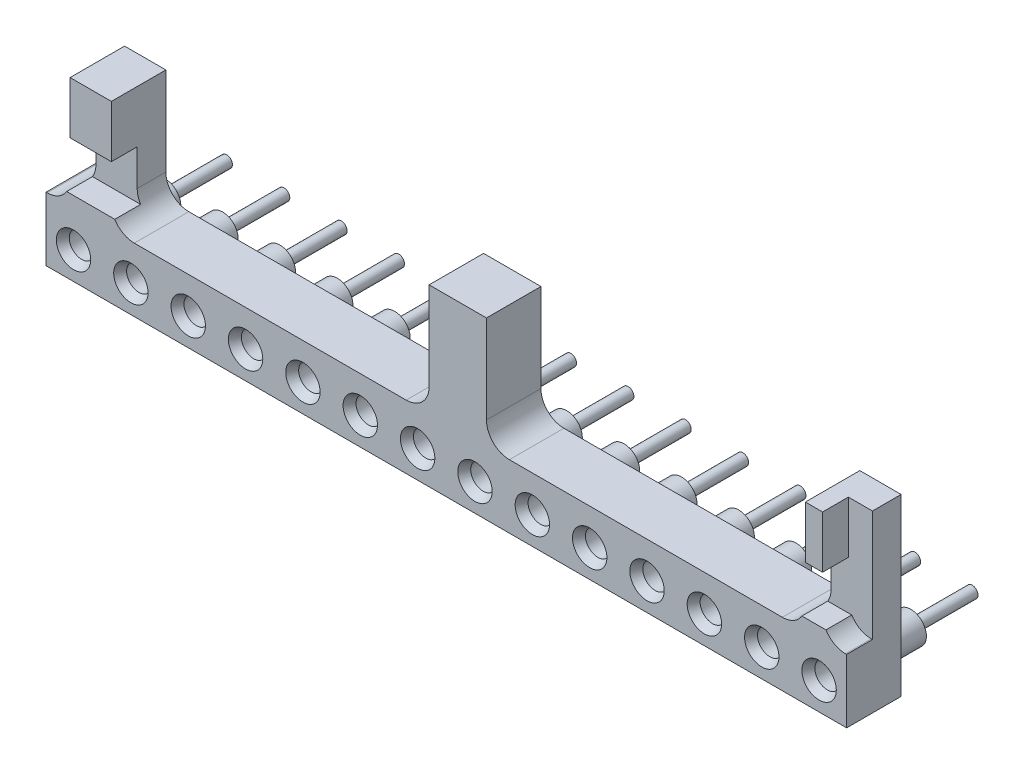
ISO-10303-21;
HEADER;
FILE_DESCRIPTION(('STEP AP214'),'2;1');
FILE_NAME('part.step','',(''),(''),'','','');
FILE_SCHEMA(('AUTOMOTIVE_DESIGN { 1 0 10303 214 1 1 1 1 }'));
ENDSEC;
DATA;
#1=APPLICATION_CONTEXT('core data for automotive mechanical design processes');
#2=APPLICATION_PROTOCOL_DEFINITION('international standard','automotive_design',2000,#1);
#3=PRODUCT_CONTEXT('',#1,'mechanical');
#4=PRODUCT('Part','Part','',(#3));
#5=PRODUCT_RELATED_PRODUCT_CATEGORY('part','',(#4));
#6=PRODUCT_DEFINITION_FORMATION('','',#4);
#7=PRODUCT_DEFINITION_CONTEXT('part definition',#1,'design');
#8=PRODUCT_DEFINITION('design','',#6,#7);
#9=PRODUCT_DEFINITION_SHAPE('','',#8);
#10=(LENGTH_UNIT() NAMED_UNIT(*) SI_UNIT(.MILLI.,.METRE.));
#11=(NAMED_UNIT(*) PLANE_ANGLE_UNIT() SI_UNIT($,.RADIAN.));
#12=(NAMED_UNIT(*) SI_UNIT($,.STERADIAN.) SOLID_ANGLE_UNIT());
#13=UNCERTAINTY_MEASURE_WITH_UNIT(LENGTH_MEASURE(1.E-05),#10,'distance_accuracy_value','');
#14=(GEOMETRIC_REPRESENTATION_CONTEXT(3) GLOBAL_UNCERTAINTY_ASSIGNED_CONTEXT((#13)) GLOBAL_UNIT_ASSIGNED_CONTEXT((#10,
#11,#12)) REPRESENTATION_CONTEXT('',''));
#15=CARTESIAN_POINT('',(0.,0.,0.));
#16=DIRECTION('',(0.,0.,1.));
#17=DIRECTION('',(1.,0.,0.));
#18=AXIS2_PLACEMENT_3D('',#15,#16,#17);
#19=CARTESIAN_POINT('',(0.,0.,0.));
#20=DIRECTION('',(0.,0.,1.));
#21=DIRECTION('',(1.,0.,0.));
#22=AXIS2_PLACEMENT_3D('',#19,#20,#21);
#23=PLANE('',#22);
#24=DIRECTION('',(1.,0.,0.));
#25=VECTOR('',#24,1.);
#26=CARTESIAN_POINT('',(19.7409414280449,-1.09065974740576,0.));
#27=LINE('',#26,#25);
#28=CARTESIAN_POINT('',(-16.6624,-1.09065974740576,0.));
#29=VERTEX_POINT('',#28);
#30=CARTESIAN_POINT('',(-14.8336,-1.09065974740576,0.));
#31=VERTEX_POINT('',#30);
#32=EDGE_CURVE('E240',#29,#31,#27,.T.);
#33=ORIENTED_EDGE('',*,*,#32,.F.);
#34=DIRECTION('',(0.,1.,0.));
#35=VECTOR('',#34,1.);
#36=CARTESIAN_POINT('',(-16.6624,5.0038,0.));
#37=LINE('',#36,#35);
#38=CARTESIAN_POINT('',(-16.6624,-3.4036,0.));
#39=VERTEX_POINT('',#38);
#40=EDGE_CURVE('E252',#39,#29,#37,.T.);
#41=ORIENTED_EDGE('',*,*,#40,.F.);
#42=DIRECTION('',(1.,0.,0.));
#43=VECTOR('',#42,1.);
#44=CARTESIAN_POINT('',(0.,-3.4036,0.));
#45=LINE('',#44,#43);
#46=CARTESIAN_POINT('',(-14.8336,-3.4036,0.));
#47=VERTEX_POINT('',#46);
#48=EDGE_CURVE('E534',#39,#47,#45,.T.);
#49=ORIENTED_EDGE('',*,*,#48,.T.);
#50=DIRECTION('',(0.,1.,0.));
#51=VECTOR('',#50,1.);
#52=CARTESIAN_POINT('',(-14.8336,-5.0038,0.));
#53=LINE('',#52,#51);
#54=EDGE_CURVE('E253',#31,#47,#53,.F.);
#55=ORIENTED_EDGE('',*,*,#54,.F.);
#56=EDGE_LOOP('',(#33,#41,#49,#55));
#57=FACE_BOUND('',#56,.T.);
#58=ADVANCED_FACE('F38',(#57),#23,.T.);
#59=CARTESIAN_POINT('',(-0.761999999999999,-1.09065974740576,0.));
#60=VERTEX_POINT('',#59);
#61=CARTESIAN_POINT('',(1.778,-1.09065974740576,0.));
#62=VERTEX_POINT('',#61);
#63=EDGE_CURVE('E255',#60,#62,#27,.T.);
#64=ORIENTED_EDGE('',*,*,#63,.F.);
#65=DIRECTION('',(0.,1.,0.));
#66=VECTOR('',#65,1.);
#67=CARTESIAN_POINT('',(-0.762,5.0038,0.));
#68=LINE('',#67,#66);
#69=CARTESIAN_POINT('',(-0.762,-5.0038,0.));
#70=VERTEX_POINT('',#69);
#71=EDGE_CURVE('E273',#70,#60,#68,.T.);
#72=ORIENTED_EDGE('',*,*,#71,.F.);
#73=CARTESIAN_POINT('',(-1.778,-5.0038,0.));
#74=DIRECTION('',(0.,0.,-1.));
#75=DIRECTION('',(-1.,0.,0.));
#76=AXIS2_PLACEMENT_3D('',#73,#74,#75);
#77=CIRCLE('',#76,1.016);
#78=CARTESIAN_POINT('',(-1.778,-6.0198,0.));
#79=VERTEX_POINT('',#78);
#80=EDGE_CURVE('E536',#70,#79,#77,.T.);
#81=ORIENTED_EDGE('',*,*,#80,.T.);
#82=DIRECTION('',(1.,0.,0.));
#83=VECTOR('',#82,1.);
#84=CARTESIAN_POINT('',(-1.778,-6.0198,0.));
#85=LINE('',#84,#83);
#86=CARTESIAN_POINT('',(-13.8176,-6.0198,0.));
#87=VERTEX_POINT('',#86);
#88=EDGE_CURVE('E470',#87,#79,#85,.T.);
#89=ORIENTED_EDGE('',*,*,#88,.F.);
#90=CARTESIAN_POINT('',(-13.8176,-5.0038,0.));
#91=DIRECTION('',(0.,0.,-1.));
#92=DIRECTION('',(-1.,0.,0.));
#93=AXIS2_PLACEMENT_3D('',#90,#91,#92);
#94=CIRCLE('',#93,1.016);
#95=CARTESIAN_POINT('',(-14.6823198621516,-5.53720000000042,0.));
#96=VERTEX_POINT('',#95);
#97=EDGE_CURVE('E419',#87,#96,#94,.T.);
#98=ORIENTED_EDGE('',*,*,#97,.T.);
#99=DIRECTION('',(1.,0.,0.));
#100=VECTOR('',#99,1.);
#101=CARTESIAN_POINT('',(0.,-5.5372,0.));
#102=LINE('',#101,#100);
#103=CARTESIAN_POINT('',(-16.813680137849,-5.5372,0.));
#104=VERTEX_POINT('',#103);
#105=EDGE_CURVE('E414',#96,#104,#102,.F.);
#106=ORIENTED_EDGE('',*,*,#105,.T.);
#107=CARTESIAN_POINT('',(-17.6784,-5.0038,0.));
#108=DIRECTION('',(0.,0.,-1.));
#109=DIRECTION('',(-1.,0.,0.));
#110=AXIS2_PLACEMENT_3D('',#107,#108,#109);
#111=CIRCLE('',#110,1.016);
#112=CARTESIAN_POINT('',(-17.6784,-6.0198,0.));
#113=VERTEX_POINT('',#112);
#114=EDGE_CURVE('E663',#104,#113,#111,.T.);
#115=ORIENTED_EDGE('',*,*,#114,.T.);
#116=DIRECTION('',(1.,0.,0.));
#117=VECTOR('',#116,1.);
#118=CARTESIAN_POINT('',(0.,-6.0198,0.));
#119=LINE('',#118,#117);
#120=CARTESIAN_POINT('',(-17.7292,-6.0198,0.));
#121=VERTEX_POINT('',#120);
#122=EDGE_CURVE('E410',#113,#121,#119,.F.);
#123=ORIENTED_EDGE('',*,*,#122,.T.);
#124=DIRECTION('',(0.,1.,0.));
#125=VECTOR('',#124,1.);
#126=CARTESIAN_POINT('',(-17.7292,-6.0198,0.));
#127=LINE('',#126,#125);
#128=CARTESIAN_POINT('',(-17.7292,-8.8392,0.));
#129=VERTEX_POINT('',#128);
#130=EDGE_CURVE('E266',#129,#121,#127,.T.);
#131=ORIENTED_EDGE('',*,*,#130,.F.);
#132=DIRECTION('',(1.,0.,0.));
#133=VECTOR('',#132,1.);
#134=CARTESIAN_POINT('',(-17.7292,-8.8392,0.));
#135=LINE('',#134,#133);
#136=CARTESIAN_POINT('',(17.7292,-8.8392,0.));
#137=VERTEX_POINT('',#136);
#138=EDGE_CURVE('E341',#137,#129,#135,.F.);
#139=ORIENTED_EDGE('',*,*,#138,.F.);
#140=DIRECTION('',(0.,1.,0.));
#141=VECTOR('',#140,1.);
#142=CARTESIAN_POINT('',(17.7292,-8.8392,0.));
#143=LINE('',#142,#141);
#144=CARTESIAN_POINT('',(17.7292,-6.0198,0.));
#145=VERTEX_POINT('',#144);
#146=EDGE_CURVE('E340',#145,#137,#143,.F.);
#147=ORIENTED_EDGE('',*,*,#146,.F.);
#148=DIRECTION('',(1.,0.,0.));
#149=VECTOR('',#148,1.);
#150=CARTESIAN_POINT('',(0.,-6.0198,0.));
#151=LINE('',#150,#149);
#152=CARTESIAN_POINT('',(17.6784,-6.0198,0.));
#153=VERTEX_POINT('',#152);
#154=EDGE_CURVE('E407',#145,#153,#151,.F.);
#155=ORIENTED_EDGE('',*,*,#154,.T.);
#156=CARTESIAN_POINT('',(17.6784,-5.0038,0.));
#157=DIRECTION('',(0.,0.,-1.));
#158=DIRECTION('',(-1.,0.,0.));
#159=AXIS2_PLACEMENT_3D('',#156,#157,#158);
#160=CIRCLE('',#159,1.016);
#161=CARTESIAN_POINT('',(16.813680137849,-5.5372,0.));
#162=VERTEX_POINT('',#161);
#163=EDGE_CURVE('E406',#153,#162,#160,.T.);
#164=ORIENTED_EDGE('',*,*,#163,.T.);
#165=DIRECTION('',(1.,0.,0.));
#166=VECTOR('',#165,1.);
#167=CARTESIAN_POINT('',(0.,-5.5372,0.));
#168=LINE('',#167,#166);
#169=CARTESIAN_POINT('',(15.7491198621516,-5.53720000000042,0.));
#170=VERTEX_POINT('',#169);
#171=EDGE_CURVE('E403',#162,#170,#168,.F.);
#172=ORIENTED_EDGE('',*,*,#171,.T.);
#173=CARTESIAN_POINT('',(14.8844,-5.0038,0.));
#174=DIRECTION('',(0.,0.,-1.));
#175=DIRECTION('',(-1.,0.,0.));
#176=AXIS2_PLACEMENT_3D('',#173,#174,#175);
#177=CIRCLE('',#176,1.016);
#178=CARTESIAN_POINT('',(14.8844,-6.0198,0.));
#179=VERTEX_POINT('',#178);
#180=EDGE_CURVE('E405',#170,#179,#177,.T.);
#181=ORIENTED_EDGE('',*,*,#180,.T.);
#182=DIRECTION('',(1.,0.,0.));
#183=VECTOR('',#182,1.);
#184=CARTESIAN_POINT('',(14.8844,-6.0198,0.));
#185=LINE('',#184,#183);
#186=CARTESIAN_POINT('',(2.794,-6.0198,0.));
#187=VERTEX_POINT('',#186);
#188=EDGE_CURVE('E455',#187,#179,#185,.T.);
#189=ORIENTED_EDGE('',*,*,#188,.F.);
#190=CARTESIAN_POINT('',(2.794,-5.0038,0.));
#191=DIRECTION('',(0.,0.,-1.));
#192=DIRECTION('',(-1.,0.,0.));
#193=AXIS2_PLACEMENT_3D('',#190,#191,#192);
#194=CIRCLE('',#193,1.016);
#195=CARTESIAN_POINT('',(1.778,-5.0038,0.));
#196=VERTEX_POINT('',#195);
#197=EDGE_CURVE('E523',#187,#196,#194,.T.);
#198=ORIENTED_EDGE('',*,*,#197,.T.);
#199=DIRECTION('',(0.,1.,0.));
#200=VECTOR('',#199,1.);
#201=CARTESIAN_POINT('',(1.778,-5.0038,0.));
#202=LINE('',#201,#200);
#203=EDGE_CURVE('E454',#62,#196,#202,.F.);
#204=ORIENTED_EDGE('',*,*,#203,.F.);
#205=EDGE_LOOP('',(#64,#72,#81,#89,#98,#106,#115,#123,#131,#139,#147,#155,#164,#172,#181,#189,
#198,#204));
#206=FACE_BOUND('',#205,.T.);
#207=CARTESIAN_POINT('',(-16.51,-7.62,-5.6843418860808E-11));
#208=DIRECTION('',(0.,0.,1.));
#209=DIRECTION('',(1.,0.,0.));
#210=AXIS2_PLACEMENT_3D('',#207,#208,#209);
#211=CIRCLE('',#210,0.761999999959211);
#212=CARTESIAN_POINT('',(-15.7480000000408,-7.62,-5.6843418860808E-11));
#213=VERTEX_POINT('',#212);
#214=EDGE_CURVE('E399',#213,#213,#211,.F.);
#215=ORIENTED_EDGE('',*,*,#214,.T.);
#216=EDGE_LOOP('',(#215));
#217=FACE_BOUND('',#216,.T.);
#218=CARTESIAN_POINT('',(-13.97,-7.62,-5.6843418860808E-11));
#219=DIRECTION('',(0.,0.,1.));
#220=DIRECTION('',(1.,0.,0.));
#221=AXIS2_PLACEMENT_3D('',#218,#219,#220);
#222=CIRCLE('',#221,0.761999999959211);
#223=CARTESIAN_POINT('',(-13.2080000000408,-7.62,-5.6843418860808E-11));
#224=VERTEX_POINT('',#223);
#225=EDGE_CURVE('E637',#224,#224,#222,.F.);
#226=ORIENTED_EDGE('',*,*,#225,.T.);
#227=EDGE_LOOP('',(#226));
#228=FACE_BOUND('',#227,.T.);
#229=CARTESIAN_POINT('',(-11.43,-7.62,-5.6843418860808E-11));
#230=DIRECTION('',(0.,0.,1.));
#231=DIRECTION('',(1.,0.,0.));
#232=AXIS2_PLACEMENT_3D('',#229,#230,#231);
#233=CIRCLE('',#232,0.761999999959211);
#234=CARTESIAN_POINT('',(-10.6680000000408,-7.62,-5.6843418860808E-11));
#235=VERTEX_POINT('',#234);
#236=EDGE_CURVE('E634',#235,#235,#233,.F.);
#237=ORIENTED_EDGE('',*,*,#236,.T.);
#238=EDGE_LOOP('',(#237));
#239=FACE_BOUND('',#238,.T.);
#240=CARTESIAN_POINT('',(-8.89,-7.62,-5.6843418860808E-11));
#241=DIRECTION('',(0.,0.,1.));
#242=DIRECTION('',(1.,0.,0.));
#243=AXIS2_PLACEMENT_3D('',#240,#241,#242);
#244=CIRCLE('',#243,0.761999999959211);
#245=CARTESIAN_POINT('',(-8.12800000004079,-7.62,-5.6843418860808E-11));
#246=VERTEX_POINT('',#245);
#247=EDGE_CURVE('E631',#246,#246,#244,.F.);
#248=ORIENTED_EDGE('',*,*,#247,.T.);
#249=EDGE_LOOP('',(#248));
#250=FACE_BOUND('',#249,.T.);
#251=CARTESIAN_POINT('',(-6.35,-7.62,-5.6843418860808E-11));
#252=DIRECTION('',(0.,0.,1.));
#253=DIRECTION('',(1.,0.,0.));
#254=AXIS2_PLACEMENT_3D('',#251,#252,#253);
#255=CIRCLE('',#254,0.761999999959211);
#256=CARTESIAN_POINT('',(-5.58800000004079,-7.62,-5.6843418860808E-11));
#257=VERTEX_POINT('',#256);
#258=EDGE_CURVE('E628',#257,#257,#255,.F.);
#259=ORIENTED_EDGE('',*,*,#258,.T.);
#260=EDGE_LOOP('',(#259));
#261=FACE_BOUND('',#260,.T.);
#262=CARTESIAN_POINT('',(-3.81,-7.62,-5.6843418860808E-11));
#263=DIRECTION('',(0.,0.,1.));
#264=DIRECTION('',(1.,0.,0.));
#265=AXIS2_PLACEMENT_3D('',#262,#263,#264);
#266=CIRCLE('',#265,0.761999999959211);
#267=CARTESIAN_POINT('',(-3.04800000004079,-7.62,-5.6843418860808E-11));
#268=VERTEX_POINT('',#267);
#269=EDGE_CURVE('E625',#268,#268,#266,.F.);
#270=ORIENTED_EDGE('',*,*,#269,.T.);
#271=EDGE_LOOP('',(#270));
#272=FACE_BOUND('',#271,.T.);
#273=CARTESIAN_POINT('',(-1.27,-7.62,-5.6843418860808E-11));
#274=DIRECTION('',(0.,0.,1.));
#275=DIRECTION('',(1.,0.,0.));
#276=AXIS2_PLACEMENT_3D('',#273,#274,#275);
#277=CIRCLE('',#276,0.761999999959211);
#278=CARTESIAN_POINT('',(-0.508000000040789,-7.62,-5.6843418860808E-11));
#279=VERTEX_POINT('',#278);
#280=EDGE_CURVE('E622',#279,#279,#277,.F.);
#281=ORIENTED_EDGE('',*,*,#280,.T.);
#282=EDGE_LOOP('',(#281));
#283=FACE_BOUND('',#282,.T.);
#284=CARTESIAN_POINT('',(1.27,-7.62,-5.6843418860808E-11));
#285=DIRECTION('',(0.,0.,1.));
#286=DIRECTION('',(1.,0.,0.));
#287=AXIS2_PLACEMENT_3D('',#284,#285,#286);
#288=CIRCLE('',#287,0.761999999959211);
#289=CARTESIAN_POINT('',(2.03199999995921,-7.62,-5.6843418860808E-11));
#290=VERTEX_POINT('',#289);
#291=EDGE_CURVE('E619',#290,#290,#288,.F.);
#292=ORIENTED_EDGE('',*,*,#291,.T.);
#293=EDGE_LOOP('',(#292));
#294=FACE_BOUND('',#293,.T.);
#295=CARTESIAN_POINT('',(3.81,-7.62,-5.6843418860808E-11));
#296=DIRECTION('',(0.,0.,1.));
#297=DIRECTION('',(1.,0.,0.));
#298=AXIS2_PLACEMENT_3D('',#295,#296,#297);
#299=CIRCLE('',#298,0.761999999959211);
#300=CARTESIAN_POINT('',(4.57199999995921,-7.62,-5.6843418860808E-11));
#301=VERTEX_POINT('',#300);
#302=EDGE_CURVE('E616',#301,#301,#299,.F.);
#303=ORIENTED_EDGE('',*,*,#302,.T.);
#304=EDGE_LOOP('',(#303));
#305=FACE_BOUND('',#304,.T.);
#306=CARTESIAN_POINT('',(6.35,-7.62,-5.6843418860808E-11));
#307=DIRECTION('',(0.,0.,1.));
#308=DIRECTION('',(1.,0.,0.));
#309=AXIS2_PLACEMENT_3D('',#306,#307,#308);
#310=CIRCLE('',#309,0.761999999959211);
#311=CARTESIAN_POINT('',(7.11199999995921,-7.62,-5.6843418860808E-11));
#312=VERTEX_POINT('',#311);
#313=EDGE_CURVE('E613',#312,#312,#310,.F.);
#314=ORIENTED_EDGE('',*,*,#313,.T.);
#315=EDGE_LOOP('',(#314));
#316=FACE_BOUND('',#315,.T.);
#317=CARTESIAN_POINT('',(8.89,-7.62,-5.6843418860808E-11));
#318=DIRECTION('',(0.,0.,1.));
#319=DIRECTION('',(1.,0.,0.));
#320=AXIS2_PLACEMENT_3D('',#317,#318,#319);
#321=CIRCLE('',#320,0.761999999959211);
#322=CARTESIAN_POINT('',(9.65199999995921,-7.62,-5.6843418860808E-11));
#323=VERTEX_POINT('',#322);
#324=EDGE_CURVE('E610',#323,#323,#321,.F.);
#325=ORIENTED_EDGE('',*,*,#324,.T.);
#326=EDGE_LOOP('',(#325));
#327=FACE_BOUND('',#326,.T.);
#328=CARTESIAN_POINT('',(11.43,-7.62,-5.6843418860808E-11));
#329=DIRECTION('',(0.,0.,1.));
#330=DIRECTION('',(1.,0.,0.));
#331=AXIS2_PLACEMENT_3D('',#328,#329,#330);
#332=CIRCLE('',#331,0.761999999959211);
#333=CARTESIAN_POINT('',(12.1919999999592,-7.62,-5.6843418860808E-11));
#334=VERTEX_POINT('',#333);
#335=EDGE_CURVE('E607',#334,#334,#332,.F.);
#336=ORIENTED_EDGE('',*,*,#335,.T.);
#337=EDGE_LOOP('',(#336));
#338=FACE_BOUND('',#337,.T.);
#339=CARTESIAN_POINT('',(13.97,-7.62,-5.6843418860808E-11));
#340=DIRECTION('',(0.,0.,1.));
#341=DIRECTION('',(1.,0.,0.));
#342=AXIS2_PLACEMENT_3D('',#339,#340,#341);
#343=CIRCLE('',#342,0.761999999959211);
#344=CARTESIAN_POINT('',(14.7319999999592,-7.62,-5.6843418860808E-11));
#345=VERTEX_POINT('',#344);
#346=EDGE_CURVE('E604',#345,#345,#343,.F.);
#347=ORIENTED_EDGE('',*,*,#346,.T.);
#348=EDGE_LOOP('',(#347));
#349=FACE_BOUND('',#348,.T.);
#350=CARTESIAN_POINT('',(16.51,-7.62,-5.6843418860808E-11));
#351=DIRECTION('',(0.,0.,1.));
#352=DIRECTION('',(1.,0.,0.));
#353=AXIS2_PLACEMENT_3D('',#350,#351,#352);
#354=CIRCLE('',#353,0.761999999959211);
#355=CARTESIAN_POINT('',(17.2719999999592,-7.62,-5.6843418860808E-11));
#356=VERTEX_POINT('',#355);
#357=EDGE_CURVE('E315',#356,#356,#354,.F.);
#358=ORIENTED_EDGE('',*,*,#357,.T.);
#359=EDGE_LOOP('',(#358));
#360=FACE_BOUND('',#359,.T.);
#361=ADVANCED_FACE('F848',(#206,#217,#228,#239,#250,#261,#272,#283,#294,#305,#316,#327,#338,
#349,#360),#23,.T.);
#362=CARTESIAN_POINT('',(-16.51,-7.62,-0.999998));
#363=DIRECTION('',(0.,0.,-1.));
#364=DIRECTION('',(-1.,0.,0.));
#365=AXIS2_PLACEMENT_3D('',#362,#363,#364);
#366=PLANE('',#365);
#367=CARTESIAN_POINT('',(-16.51,-7.62,-0.999998));
#368=DIRECTION('',(0.,0.,1.));
#369=DIRECTION('',(1.,0.,0.));
#370=AXIS2_PLACEMENT_3D('',#367,#368,#369);
#371=CIRCLE('',#370,0.55245);
#372=CARTESIAN_POINT('',(-15.95755,-7.62,-0.999998));
#373=VERTEX_POINT('',#372);
#374=EDGE_CURVE('E706',#373,#373,#371,.T.);
#375=ORIENTED_EDGE('',*,*,#374,.T.);
#376=EDGE_LOOP('',(#375));
#377=FACE_BOUND('',#376,.T.);
#378=ADVANCED_FACE('F853',(#377),#366,.F.);
#379=CARTESIAN_POINT('',(-13.97,-7.62,-0.999998));
#380=DIRECTION('',(0.,0.,-1.));
#381=DIRECTION('',(-1.,0.,0.));
#382=AXIS2_PLACEMENT_3D('',#379,#380,#381);
#383=PLANE('',#382);
#384=CARTESIAN_POINT('',(-13.97,-7.62,-0.999998));
#385=DIRECTION('',(0.,0.,1.));
#386=DIRECTION('',(1.,0.,0.));
#387=AXIS2_PLACEMENT_3D('',#384,#385,#386);
#388=CIRCLE('',#387,0.55245);
#389=CARTESIAN_POINT('',(-13.41755,-7.62,-0.999998));
#390=VERTEX_POINT('',#389);
#391=EDGE_CURVE('E703',#390,#390,#388,.T.);
#392=ORIENTED_EDGE('',*,*,#391,.T.);
#393=EDGE_LOOP('',(#392));
#394=FACE_BOUND('',#393,.T.);
#395=ADVANCED_FACE('F1124',(#394),#383,.F.);
#396=CARTESIAN_POINT('',(-11.43,-7.62,-0.999998));
#397=DIRECTION('',(0.,0.,-1.));
#398=DIRECTION('',(-1.,0.,0.));
#399=AXIS2_PLACEMENT_3D('',#396,#397,#398);
#400=PLANE('',#399);
#401=CARTESIAN_POINT('',(-11.43,-7.62,-0.999998));
#402=DIRECTION('',(0.,0.,1.));
#403=DIRECTION('',(1.,0.,0.));
#404=AXIS2_PLACEMENT_3D('',#401,#402,#403);
#405=CIRCLE('',#404,0.55245);
#406=CARTESIAN_POINT('',(-10.87755,-7.62,-0.999998));
#407=VERTEX_POINT('',#406);
#408=EDGE_CURVE('E700',#407,#407,#405,.T.);
#409=ORIENTED_EDGE('',*,*,#408,.T.);
#410=EDGE_LOOP('',(#409));
#411=FACE_BOUND('',#410,.T.);
#412=ADVANCED_FACE('F1120',(#411),#400,.F.);
#413=CARTESIAN_POINT('',(-8.89,-7.62,-0.999998));
#414=DIRECTION('',(0.,0.,-1.));
#415=DIRECTION('',(-1.,0.,0.));
#416=AXIS2_PLACEMENT_3D('',#413,#414,#415);
#417=PLANE('',#416);
#418=CARTESIAN_POINT('',(-8.89,-7.62,-0.999998));
#419=DIRECTION('',(0.,0.,1.));
#420=DIRECTION('',(1.,0.,0.));
#421=AXIS2_PLACEMENT_3D('',#418,#419,#420);
#422=CIRCLE('',#421,0.55245);
#423=CARTESIAN_POINT('',(-8.33755,-7.62,-0.999998));
#424=VERTEX_POINT('',#423);
#425=EDGE_CURVE('E697',#424,#424,#422,.T.);
#426=ORIENTED_EDGE('',*,*,#425,.T.);
#427=EDGE_LOOP('',(#426));
#428=FACE_BOUND('',#427,.T.);
#429=ADVANCED_FACE('F1116',(#428),#417,.F.);
#430=CARTESIAN_POINT('',(-6.35,-7.62,-0.999998));
#431=DIRECTION('',(0.,0.,-1.));
#432=DIRECTION('',(-1.,0.,0.));
#433=AXIS2_PLACEMENT_3D('',#430,#431,#432);
#434=PLANE('',#433);
#435=CARTESIAN_POINT('',(-6.35,-7.62,-0.999998));
#436=DIRECTION('',(0.,0.,1.));
#437=DIRECTION('',(1.,0.,0.));
#438=AXIS2_PLACEMENT_3D('',#435,#436,#437);
#439=CIRCLE('',#438,0.55245);
#440=CARTESIAN_POINT('',(-5.79755,-7.62,-0.999998));
#441=VERTEX_POINT('',#440);
#442=EDGE_CURVE('E694',#441,#441,#439,.T.);
#443=ORIENTED_EDGE('',*,*,#442,.T.);
#444=EDGE_LOOP('',(#443));
#445=FACE_BOUND('',#444,.T.);
#446=ADVANCED_FACE('F1112',(#445),#434,.F.);
#447=CARTESIAN_POINT('',(-3.81,-7.62,-0.999998));
#448=DIRECTION('',(0.,0.,-1.));
#449=DIRECTION('',(-1.,0.,0.));
#450=AXIS2_PLACEMENT_3D('',#447,#448,#449);
#451=PLANE('',#450);
#452=CARTESIAN_POINT('',(-3.81,-7.62,-0.999998));
#453=DIRECTION('',(0.,0.,1.));
#454=DIRECTION('',(1.,0.,0.));
#455=AXIS2_PLACEMENT_3D('',#452,#453,#454);
#456=CIRCLE('',#455,0.55245);
#457=CARTESIAN_POINT('',(-3.25755,-7.62,-0.999998));
#458=VERTEX_POINT('',#457);
#459=EDGE_CURVE('E691',#458,#458,#456,.T.);
#460=ORIENTED_EDGE('',*,*,#459,.T.);
#461=EDGE_LOOP('',(#460));
#462=FACE_BOUND('',#461,.T.);
#463=ADVANCED_FACE('F1108',(#462),#451,.F.);
#464=CARTESIAN_POINT('',(-1.27,-7.62,-0.999998));
#465=DIRECTION('',(0.,0.,-1.));
#466=DIRECTION('',(-1.,0.,0.));
#467=AXIS2_PLACEMENT_3D('',#464,#465,#466);
#468=PLANE('',#467);
#469=CARTESIAN_POINT('',(-1.27,-7.62,-0.999998));
#470=DIRECTION('',(0.,0.,1.));
#471=DIRECTION('',(1.,0.,0.));
#472=AXIS2_PLACEMENT_3D('',#469,#470,#471);
#473=CIRCLE('',#472,0.55245);
#474=CARTESIAN_POINT('',(-0.71755,-7.62,-0.999998));
#475=VERTEX_POINT('',#474);
#476=EDGE_CURVE('E688',#475,#475,#473,.T.);
#477=ORIENTED_EDGE('',*,*,#476,.T.);
#478=EDGE_LOOP('',(#477));
#479=FACE_BOUND('',#478,.T.);
#480=ADVANCED_FACE('F1104',(#479),#468,.F.);
#481=CARTESIAN_POINT('',(1.27,-7.62,-0.999998));
#482=DIRECTION('',(0.,0.,-1.));
#483=DIRECTION('',(-1.,0.,0.));
#484=AXIS2_PLACEMENT_3D('',#481,#482,#483);
#485=PLANE('',#484);
#486=CARTESIAN_POINT('',(1.27,-7.62,-0.999998));
#487=DIRECTION('',(0.,0.,1.));
#488=DIRECTION('',(1.,0.,0.));
#489=AXIS2_PLACEMENT_3D('',#486,#487,#488);
#490=CIRCLE('',#489,0.55245);
#491=CARTESIAN_POINT('',(1.82245,-7.62,-0.999998));
#492=VERTEX_POINT('',#491);
#493=EDGE_CURVE('E685',#492,#492,#490,.T.);
#494=ORIENTED_EDGE('',*,*,#493,.T.);
#495=EDGE_LOOP('',(#494));
#496=FACE_BOUND('',#495,.T.);
#497=ADVANCED_FACE('F1100',(#496),#485,.F.);
#498=CARTESIAN_POINT('',(3.81,-7.62,-0.999998));
#499=DIRECTION('',(0.,0.,-1.));
#500=DIRECTION('',(-1.,0.,0.));
#501=AXIS2_PLACEMENT_3D('',#498,#499,#500);
#502=PLANE('',#501);
#503=CARTESIAN_POINT('',(3.81,-7.62,-0.999998));
#504=DIRECTION('',(0.,0.,1.));
#505=DIRECTION('',(1.,0.,0.));
#506=AXIS2_PLACEMENT_3D('',#503,#504,#505);
#507=CIRCLE('',#506,0.55245);
#508=CARTESIAN_POINT('',(4.36245,-7.62,-0.999998));
#509=VERTEX_POINT('',#508);
#510=EDGE_CURVE('E682',#509,#509,#507,.T.);
#511=ORIENTED_EDGE('',*,*,#510,.T.);
#512=EDGE_LOOP('',(#511));
#513=FACE_BOUND('',#512,.T.);
#514=ADVANCED_FACE('F1096',(#513),#502,.F.);
#515=CARTESIAN_POINT('',(6.35,-7.62,-0.999998));
#516=DIRECTION('',(0.,0.,-1.));
#517=DIRECTION('',(-1.,0.,0.));
#518=AXIS2_PLACEMENT_3D('',#515,#516,#517);
#519=PLANE('',#518);
#520=CARTESIAN_POINT('',(6.35,-7.62,-0.999998));
#521=DIRECTION('',(0.,0.,1.));
#522=DIRECTION('',(1.,0.,0.));
#523=AXIS2_PLACEMENT_3D('',#520,#521,#522);
#524=CIRCLE('',#523,0.55245);
#525=CARTESIAN_POINT('',(6.90245,-7.62,-0.999998));
#526=VERTEX_POINT('',#525);
#527=EDGE_CURVE('E679',#526,#526,#524,.T.);
#528=ORIENTED_EDGE('',*,*,#527,.T.);
#529=EDGE_LOOP('',(#528));
#530=FACE_BOUND('',#529,.T.);
#531=ADVANCED_FACE('F1092',(#530),#519,.F.);
#532=CARTESIAN_POINT('',(8.89,-7.62,-0.999998));
#533=DIRECTION('',(0.,0.,-1.));
#534=DIRECTION('',(-1.,0.,0.));
#535=AXIS2_PLACEMENT_3D('',#532,#533,#534);
#536=PLANE('',#535);
#537=CARTESIAN_POINT('',(8.89,-7.62,-0.999998));
#538=DIRECTION('',(0.,0.,1.));
#539=DIRECTION('',(1.,0.,0.));
#540=AXIS2_PLACEMENT_3D('',#537,#538,#539);
#541=CIRCLE('',#540,0.55245);
#542=CARTESIAN_POINT('',(9.44245,-7.62,-0.999998));
#543=VERTEX_POINT('',#542);
#544=EDGE_CURVE('E676',#543,#543,#541,.T.);
#545=ORIENTED_EDGE('',*,*,#544,.T.);
#546=EDGE_LOOP('',(#545));
#547=FACE_BOUND('',#546,.T.);
#548=ADVANCED_FACE('F1088',(#547),#536,.F.);
#549=CARTESIAN_POINT('',(11.43,-7.62,-0.999998));
#550=DIRECTION('',(0.,0.,-1.));
#551=DIRECTION('',(-1.,0.,0.));
#552=AXIS2_PLACEMENT_3D('',#549,#550,#551);
#553=PLANE('',#552);
#554=CARTESIAN_POINT('',(11.43,-7.62,-0.999998));
#555=DIRECTION('',(0.,0.,1.));
#556=DIRECTION('',(1.,0.,0.));
#557=AXIS2_PLACEMENT_3D('',#554,#555,#556);
#558=CIRCLE('',#557,0.55245);
#559=CARTESIAN_POINT('',(11.98245,-7.62,-0.999998));
#560=VERTEX_POINT('',#559);
#561=EDGE_CURVE('E673',#560,#560,#558,.T.);
#562=ORIENTED_EDGE('',*,*,#561,.T.);
#563=EDGE_LOOP('',(#562));
#564=FACE_BOUND('',#563,.T.);
#565=ADVANCED_FACE('F1084',(#564),#553,.F.);
#566=CARTESIAN_POINT('',(13.97,-7.62,-0.999998));
#567=DIRECTION('',(0.,0.,-1.));
#568=DIRECTION('',(-1.,0.,0.));
#569=AXIS2_PLACEMENT_3D('',#566,#567,#568);
#570=PLANE('',#569);
#571=CARTESIAN_POINT('',(13.97,-7.62,-0.999998));
#572=DIRECTION('',(0.,0.,1.));
#573=DIRECTION('',(1.,0.,0.));
#574=AXIS2_PLACEMENT_3D('',#571,#572,#573);
#575=CIRCLE('',#574,0.55245);
#576=CARTESIAN_POINT('',(14.52245,-7.62,-0.999998));
#577=VERTEX_POINT('',#576);
#578=EDGE_CURVE('E670',#577,#577,#575,.T.);
#579=ORIENTED_EDGE('',*,*,#578,.T.);
#580=EDGE_LOOP('',(#579));
#581=FACE_BOUND('',#580,.T.);
#582=ADVANCED_FACE('F1080',(#581),#570,.F.);
#583=CARTESIAN_POINT('',(16.51,-7.62,-0.999998));
#584=DIRECTION('',(0.,0.,-1.));
#585=DIRECTION('',(-1.,0.,0.));
#586=AXIS2_PLACEMENT_3D('',#583,#584,#585);
#587=PLANE('',#586);
#588=CARTESIAN_POINT('',(16.51,-7.62,-0.999998));
#589=DIRECTION('',(0.,0.,1.));
#590=DIRECTION('',(1.,0.,0.));
#591=AXIS2_PLACEMENT_3D('',#588,#589,#590);
#592=CIRCLE('',#591,0.55245);
#593=CARTESIAN_POINT('',(17.06245,-7.62,-0.999998));
#594=VERTEX_POINT('',#593);
#595=EDGE_CURVE('E667',#594,#594,#592,.T.);
#596=ORIENTED_EDGE('',*,*,#595,.T.);
#597=EDGE_LOOP('',(#596));
#598=FACE_BOUND('',#597,.T.);
#599=ADVANCED_FACE('F1077',(#598),#587,.F.);
#600=CARTESIAN_POINT('',(0.,0.,-1.143));
#601=DIRECTION('',(0.,0.,1.));
#602=DIRECTION('',(1.,0.,0.));
#603=AXIS2_PLACEMENT_3D('',#600,#601,#602);
#604=PLANE('',#603);
#605=DIRECTION('',(1.,0.,0.));
#606=VECTOR('',#605,1.);
#607=CARTESIAN_POINT('',(-14.8336,-3.4036,-1.143));
#608=LINE('',#607,#606);
#609=CARTESIAN_POINT('',(-14.8336,-3.4036,-1.143));
#610=VERTEX_POINT('',#609);
#611=CARTESIAN_POINT('',(-16.6624,-3.4036,-1.143));
#612=VERTEX_POINT('',#611);
#613=EDGE_CURVE('E366',#610,#612,#608,.F.);
#614=ORIENTED_EDGE('',*,*,#613,.T.);
#615=DIRECTION('',(0.,1.,0.));
#616=VECTOR('',#615,1.);
#617=CARTESIAN_POINT('',(-16.6624,0.,-1.143));
#618=LINE('',#617,#616);
#619=CARTESIAN_POINT('',(-16.6624,-5.0038,-1.143));
#620=VERTEX_POINT('',#619);
#621=EDGE_CURVE('E709',#612,#620,#618,.F.);
#622=ORIENTED_EDGE('',*,*,#621,.T.);
#623=CARTESIAN_POINT('',(-17.6784,-5.0038,-1.143));
#624=DIRECTION('',(0.,0.,-1.));
#625=DIRECTION('',(-1.,0.,0.));
#626=AXIS2_PLACEMENT_3D('',#623,#624,#625);
#627=CIRCLE('',#626,1.016);
#628=CARTESIAN_POINT('',(-16.813680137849,-5.5372,-1.143));
#629=VERTEX_POINT('',#628);
#630=EDGE_CURVE('E665',#620,#629,#627,.T.);
#631=ORIENTED_EDGE('',*,*,#630,.T.);
#632=DIRECTION('',(1.,0.,0.));
#633=VECTOR('',#632,1.);
#634=CARTESIAN_POINT('',(-16.81368013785,-5.5372,-1.143));
#635=LINE('',#634,#633);
#636=CARTESIAN_POINT('',(-14.6823198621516,-5.53720000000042,-1.143));
#637=VERTEX_POINT('',#636);
#638=EDGE_CURVE('E332',#629,#637,#635,.T.);
#639=ORIENTED_EDGE('',*,*,#638,.T.);
#640=CARTESIAN_POINT('',(-13.8176,-5.0038,-1.143));
#641=DIRECTION('',(0.,0.,-1.));
#642=DIRECTION('',(-1.,0.,0.));
#643=AXIS2_PLACEMENT_3D('',#640,#641,#642);
#644=CIRCLE('',#643,1.016);
#645=CARTESIAN_POINT('',(-14.8336,-5.0038,-1.143));
#646=VERTEX_POINT('',#645);
#647=EDGE_CURVE('E245',#637,#646,#644,.T.);
#648=ORIENTED_EDGE('',*,*,#647,.T.);
#649=DIRECTION('',(0.,1.,0.));
#650=VECTOR('',#649,1.);
#651=CARTESIAN_POINT('',(-14.8336,0.,-1.143));
#652=LINE('',#651,#650);
#653=EDGE_CURVE('E710',#646,#610,#652,.T.);
#654=ORIENTED_EDGE('',*,*,#653,.T.);
#655=EDGE_LOOP('',(#614,#622,#631,#639,#648,#654));
#656=FACE_BOUND('',#655,.T.);
#657=ADVANCED_FACE('F1073',(#656),#604,.T.);
#658=CARTESIAN_POINT('',(-16.51,-7.62,0.12065));
#659=DIRECTION('',(0.,0.,1.));
#660=DIRECTION('',(1.,0.,0.));
#661=AXIS2_PLACEMENT_3D('',#658,#659,#660);
#662=CYLINDRICAL_SURFACE('',#661,0.55245);
#663=ORIENTED_EDGE('',*,*,#374,.F.);
#664=EDGE_LOOP('',(#663));
#665=FACE_BOUND('',#664,.T.);
#666=CARTESIAN_POINT('',(-16.51,-7.62,-0.36295124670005));
#667=DIRECTION('',(0.,0.,1.));
#668=DIRECTION('',(0.,-1.,0.));
#669=AXIS2_PLACEMENT_3D('',#666,#667,#668);
#670=CIRCLE('',#669,0.552450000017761);
#671=CARTESIAN_POINT('',(-16.51,-8.17245000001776,-0.36295124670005));
#672=VERTEX_POINT('',#671);
#673=EDGE_CURVE('E331',#672,#672,#670,.T.);
#674=ORIENTED_EDGE('',*,*,#673,.T.);
#675=EDGE_LOOP('',(#674));
#676=FACE_BOUND('',#675,.T.);
#677=ADVANCED_FACE('F1069',(#665,#676),#662,.F.);
#678=CARTESIAN_POINT('',(-13.97,-7.62,0.12065));
#679=DIRECTION('',(0.,0.,1.));
#680=DIRECTION('',(1.,0.,0.));
#681=AXIS2_PLACEMENT_3D('',#678,#679,#680);
#682=CYLINDRICAL_SURFACE('',#681,0.55245);
#683=ORIENTED_EDGE('',*,*,#391,.F.);
#684=EDGE_LOOP('',(#683));
#685=FACE_BOUND('',#684,.T.);
#686=CARTESIAN_POINT('',(-13.97,-7.62,-0.36295124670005));
#687=DIRECTION('',(0.,0.,1.));
#688=DIRECTION('',(0.,-1.,0.));
#689=AXIS2_PLACEMENT_3D('',#686,#687,#688);
#690=CIRCLE('',#689,0.552450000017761);
#691=CARTESIAN_POINT('',(-13.97,-8.17245000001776,-0.36295124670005));
#692=VERTEX_POINT('',#691);
#693=EDGE_CURVE('E2420',#692,#692,#690,.T.);
#694=ORIENTED_EDGE('',*,*,#693,.T.);
#695=EDGE_LOOP('',(#694));
#696=FACE_BOUND('',#695,.T.);
#697=ADVANCED_FACE('F1065',(#685,#696),#682,.F.);
#698=CARTESIAN_POINT('',(-11.43,-7.62,0.12065));
#699=DIRECTION('',(0.,0.,1.));
#700=DIRECTION('',(1.,0.,0.));
#701=AXIS2_PLACEMENT_3D('',#698,#699,#700);
#702=CYLINDRICAL_SURFACE('',#701,0.55245);
#703=ORIENTED_EDGE('',*,*,#408,.F.);
#704=EDGE_LOOP('',(#703));
#705=FACE_BOUND('',#704,.T.);
#706=CARTESIAN_POINT('',(-11.43,-7.62,-0.36295124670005));
#707=DIRECTION('',(0.,0.,1.));
#708=DIRECTION('',(0.,-1.,0.));
#709=AXIS2_PLACEMENT_3D('',#706,#707,#708);
#710=CIRCLE('',#709,0.552450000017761);
#711=CARTESIAN_POINT('',(-11.43,-8.17245000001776,-0.36295124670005));
#712=VERTEX_POINT('',#711);
#713=EDGE_CURVE('E2418',#712,#712,#710,.T.);
#714=ORIENTED_EDGE('',*,*,#713,.T.);
#715=EDGE_LOOP('',(#714));
#716=FACE_BOUND('',#715,.T.);
#717=ADVANCED_FACE('F1061',(#705,#716),#702,.F.);
#718=CARTESIAN_POINT('',(-8.89,-7.62,0.12065));
#719=DIRECTION('',(0.,0.,1.));
#720=DIRECTION('',(1.,0.,0.));
#721=AXIS2_PLACEMENT_3D('',#718,#719,#720);
#722=CYLINDRICAL_SURFACE('',#721,0.55245);
#723=ORIENTED_EDGE('',*,*,#425,.F.);
#724=EDGE_LOOP('',(#723));
#725=FACE_BOUND('',#724,.T.);
#726=CARTESIAN_POINT('',(-8.89,-7.62,-0.36295124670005));
#727=DIRECTION('',(0.,0.,1.));
#728=DIRECTION('',(0.,-1.,0.));
#729=AXIS2_PLACEMENT_3D('',#726,#727,#728);
#730=CIRCLE('',#729,0.552450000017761);
#731=CARTESIAN_POINT('',(-8.89,-8.17245000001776,-0.36295124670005));
#732=VERTEX_POINT('',#731);
#733=EDGE_CURVE('E2415',#732,#732,#730,.T.);
#734=ORIENTED_EDGE('',*,*,#733,.T.);
#735=EDGE_LOOP('',(#734));
#736=FACE_BOUND('',#735,.T.);
#737=ADVANCED_FACE('F1057',(#725,#736),#722,.F.);
#738=CARTESIAN_POINT('',(-6.35,-7.62,0.12065));
#739=DIRECTION('',(0.,0.,1.));
#740=DIRECTION('',(1.,0.,0.));
#741=AXIS2_PLACEMENT_3D('',#738,#739,#740);
#742=CYLINDRICAL_SURFACE('',#741,0.55245);
#743=ORIENTED_EDGE('',*,*,#442,.F.);
#744=EDGE_LOOP('',(#743));
#745=FACE_BOUND('',#744,.T.);
#746=CARTESIAN_POINT('',(-6.35,-7.62,-0.36295124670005));
#747=DIRECTION('',(0.,0.,1.));
#748=DIRECTION('',(0.,-1.,0.));
#749=AXIS2_PLACEMENT_3D('',#746,#747,#748);
#750=CIRCLE('',#749,0.552450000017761);
#751=CARTESIAN_POINT('',(-6.35,-8.17245000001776,-0.36295124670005));
#752=VERTEX_POINT('',#751);
#753=EDGE_CURVE('E2412',#752,#752,#750,.T.);
#754=ORIENTED_EDGE('',*,*,#753,.T.);
#755=EDGE_LOOP('',(#754));
#756=FACE_BOUND('',#755,.T.);
#757=ADVANCED_FACE('F1053',(#745,#756),#742,.F.);
#758=CARTESIAN_POINT('',(-3.81,-7.62,0.12065));
#759=DIRECTION('',(0.,0.,1.));
#760=DIRECTION('',(1.,0.,0.));
#761=AXIS2_PLACEMENT_3D('',#758,#759,#760);
#762=CYLINDRICAL_SURFACE('',#761,0.55245);
#763=ORIENTED_EDGE('',*,*,#459,.F.);
#764=EDGE_LOOP('',(#763));
#765=FACE_BOUND('',#764,.T.);
#766=CARTESIAN_POINT('',(-3.81,-7.62,-0.36295124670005));
#767=DIRECTION('',(0.,0.,1.));
#768=DIRECTION('',(0.,-1.,0.));
#769=AXIS2_PLACEMENT_3D('',#766,#767,#768);
#770=CIRCLE('',#769,0.552450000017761);
#771=CARTESIAN_POINT('',(-3.81,-8.17245000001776,-0.36295124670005));
#772=VERTEX_POINT('',#771);
#773=EDGE_CURVE('E2409',#772,#772,#770,.T.);
#774=ORIENTED_EDGE('',*,*,#773,.T.);
#775=EDGE_LOOP('',(#774));
#776=FACE_BOUND('',#775,.T.);
#777=ADVANCED_FACE('F1049',(#765,#776),#762,.F.);
#778=CARTESIAN_POINT('',(-1.27,-7.62,0.12065));
#779=DIRECTION('',(0.,0.,1.));
#780=DIRECTION('',(1.,0.,0.));
#781=AXIS2_PLACEMENT_3D('',#778,#779,#780);
#782=CYLINDRICAL_SURFACE('',#781,0.55245);
#783=ORIENTED_EDGE('',*,*,#476,.F.);
#784=EDGE_LOOP('',(#783));
#785=FACE_BOUND('',#784,.T.);
#786=CARTESIAN_POINT('',(-1.27,-7.62,-0.36295124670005));
#787=DIRECTION('',(0.,0.,1.));
#788=DIRECTION('',(0.,-1.,0.));
#789=AXIS2_PLACEMENT_3D('',#786,#787,#788);
#790=CIRCLE('',#789,0.552450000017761);
#791=CARTESIAN_POINT('',(-1.27,-8.17245000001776,-0.36295124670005));
#792=VERTEX_POINT('',#791);
#793=EDGE_CURVE('E2406',#792,#792,#790,.T.);
#794=ORIENTED_EDGE('',*,*,#793,.T.);
#795=EDGE_LOOP('',(#794));
#796=FACE_BOUND('',#795,.T.);
#797=ADVANCED_FACE('F1045',(#785,#796),#782,.F.);
#798=CARTESIAN_POINT('',(1.27,-7.62,0.12065));
#799=DIRECTION('',(0.,0.,1.));
#800=DIRECTION('',(1.,0.,0.));
#801=AXIS2_PLACEMENT_3D('',#798,#799,#800);
#802=CYLINDRICAL_SURFACE('',#801,0.55245);
#803=ORIENTED_EDGE('',*,*,#493,.F.);
#804=EDGE_LOOP('',(#803));
#805=FACE_BOUND('',#804,.T.);
#806=CARTESIAN_POINT('',(1.27,-7.62,-0.36295124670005));
#807=DIRECTION('',(0.,0.,1.));
#808=DIRECTION('',(0.,-1.,0.));
#809=AXIS2_PLACEMENT_3D('',#806,#807,#808);
#810=CIRCLE('',#809,0.552450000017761);
#811=CARTESIAN_POINT('',(1.27,-8.17245000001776,-0.36295124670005));
#812=VERTEX_POINT('',#811);
#813=EDGE_CURVE('E2403',#812,#812,#810,.T.);
#814=ORIENTED_EDGE('',*,*,#813,.T.);
#815=EDGE_LOOP('',(#814));
#816=FACE_BOUND('',#815,.T.);
#817=ADVANCED_FACE('F1041',(#805,#816),#802,.F.);
#818=CARTESIAN_POINT('',(3.81,-7.62,0.12065));
#819=DIRECTION('',(0.,0.,1.));
#820=DIRECTION('',(1.,0.,0.));
#821=AXIS2_PLACEMENT_3D('',#818,#819,#820);
#822=CYLINDRICAL_SURFACE('',#821,0.55245);
#823=ORIENTED_EDGE('',*,*,#510,.F.);
#824=EDGE_LOOP('',(#823));
#825=FACE_BOUND('',#824,.T.);
#826=CARTESIAN_POINT('',(3.81,-7.62,-0.36295124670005));
#827=DIRECTION('',(0.,0.,1.));
#828=DIRECTION('',(0.,-1.,0.));
#829=AXIS2_PLACEMENT_3D('',#826,#827,#828);
#830=CIRCLE('',#829,0.552450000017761);
#831=CARTESIAN_POINT('',(3.81,-8.17245000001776,-0.36295124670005));
#832=VERTEX_POINT('',#831);
#833=EDGE_CURVE('E2400',#832,#832,#830,.T.);
#834=ORIENTED_EDGE('',*,*,#833,.T.);
#835=EDGE_LOOP('',(#834));
#836=FACE_BOUND('',#835,.T.);
#837=ADVANCED_FACE('F1037',(#825,#836),#822,.F.);
#838=CARTESIAN_POINT('',(6.35,-7.62,0.12065));
#839=DIRECTION('',(0.,0.,1.));
#840=DIRECTION('',(1.,0.,0.));
#841=AXIS2_PLACEMENT_3D('',#838,#839,#840);
#842=CYLINDRICAL_SURFACE('',#841,0.55245);
#843=ORIENTED_EDGE('',*,*,#527,.F.);
#844=EDGE_LOOP('',(#843));
#845=FACE_BOUND('',#844,.T.);
#846=CARTESIAN_POINT('',(6.35,-7.62,-0.36295124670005));
#847=DIRECTION('',(0.,0.,1.));
#848=DIRECTION('',(0.,-1.,0.));
#849=AXIS2_PLACEMENT_3D('',#846,#847,#848);
#850=CIRCLE('',#849,0.552450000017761);
#851=CARTESIAN_POINT('',(6.35,-8.17245000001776,-0.36295124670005));
#852=VERTEX_POINT('',#851);
#853=EDGE_CURVE('E2397',#852,#852,#850,.T.);
#854=ORIENTED_EDGE('',*,*,#853,.T.);
#855=EDGE_LOOP('',(#854));
#856=FACE_BOUND('',#855,.T.);
#857=ADVANCED_FACE('F1033',(#845,#856),#842,.F.);
#858=CARTESIAN_POINT('',(8.89,-7.62,0.12065));
#859=DIRECTION('',(0.,0.,1.));
#860=DIRECTION('',(1.,0.,0.));
#861=AXIS2_PLACEMENT_3D('',#858,#859,#860);
#862=CYLINDRICAL_SURFACE('',#861,0.55245);
#863=ORIENTED_EDGE('',*,*,#544,.F.);
#864=EDGE_LOOP('',(#863));
#865=FACE_BOUND('',#864,.T.);
#866=CARTESIAN_POINT('',(8.89,-7.62,-0.36295124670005));
#867=DIRECTION('',(0.,0.,1.));
#868=DIRECTION('',(0.,-1.,0.));
#869=AXIS2_PLACEMENT_3D('',#866,#867,#868);
#870=CIRCLE('',#869,0.552450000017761);
#871=CARTESIAN_POINT('',(8.89,-8.17245000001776,-0.36295124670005));
#872=VERTEX_POINT('',#871);
#873=EDGE_CURVE('E2394',#872,#872,#870,.T.);
#874=ORIENTED_EDGE('',*,*,#873,.T.);
#875=EDGE_LOOP('',(#874));
#876=FACE_BOUND('',#875,.T.);
#877=ADVANCED_FACE('F1029',(#865,#876),#862,.F.);
#878=CARTESIAN_POINT('',(11.43,-7.62,0.12065));
#879=DIRECTION('',(0.,0.,1.));
#880=DIRECTION('',(1.,0.,0.));
#881=AXIS2_PLACEMENT_3D('',#878,#879,#880);
#882=CYLINDRICAL_SURFACE('',#881,0.55245);
#883=ORIENTED_EDGE('',*,*,#561,.F.);
#884=EDGE_LOOP('',(#883));
#885=FACE_BOUND('',#884,.T.);
#886=CARTESIAN_POINT('',(11.43,-7.62,-0.36295124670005));
#887=DIRECTION('',(0.,0.,1.));
#888=DIRECTION('',(0.,-1.,0.));
#889=AXIS2_PLACEMENT_3D('',#886,#887,#888);
#890=CIRCLE('',#889,0.552450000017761);
#891=CARTESIAN_POINT('',(11.43,-8.17245000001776,-0.36295124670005));
#892=VERTEX_POINT('',#891);
#893=EDGE_CURVE('E2391',#892,#892,#890,.T.);
#894=ORIENTED_EDGE('',*,*,#893,.T.);
#895=EDGE_LOOP('',(#894));
#896=FACE_BOUND('',#895,.T.);
#897=ADVANCED_FACE('F1025',(#885,#896),#882,.F.);
#898=CARTESIAN_POINT('',(13.97,-7.62,0.12065));
#899=DIRECTION('',(0.,0.,1.));
#900=DIRECTION('',(1.,0.,0.));
#901=AXIS2_PLACEMENT_3D('',#898,#899,#900);
#902=CYLINDRICAL_SURFACE('',#901,0.55245);
#903=ORIENTED_EDGE('',*,*,#578,.F.);
#904=EDGE_LOOP('',(#903));
#905=FACE_BOUND('',#904,.T.);
#906=CARTESIAN_POINT('',(13.97,-7.62,-0.36295124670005));
#907=DIRECTION('',(0.,0.,1.));
#908=DIRECTION('',(0.,-1.,0.));
#909=AXIS2_PLACEMENT_3D('',#906,#907,#908);
#910=CIRCLE('',#909,0.552450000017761);
#911=CARTESIAN_POINT('',(13.97,-8.17245000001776,-0.36295124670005));
#912=VERTEX_POINT('',#911);
#913=EDGE_CURVE('E2388',#912,#912,#910,.T.);
#914=ORIENTED_EDGE('',*,*,#913,.T.);
#915=EDGE_LOOP('',(#914));
#916=FACE_BOUND('',#915,.T.);
#917=ADVANCED_FACE('F1021',(#905,#916),#902,.F.);
#918=CARTESIAN_POINT('',(16.51,-7.62,0.12065));
#919=DIRECTION('',(0.,0.,1.));
#920=DIRECTION('',(1.,0.,0.));
#921=AXIS2_PLACEMENT_3D('',#918,#919,#920);
#922=CYLINDRICAL_SURFACE('',#921,0.55245);
#923=ORIENTED_EDGE('',*,*,#595,.F.);
#924=EDGE_LOOP('',(#923));
#925=FACE_BOUND('',#924,.T.);
#926=CARTESIAN_POINT('',(16.51,-7.62,-0.36295124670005));
#927=DIRECTION('',(0.,0.,1.));
#928=DIRECTION('',(0.,-1.,0.));
#929=AXIS2_PLACEMENT_3D('',#926,#927,#928);
#930=CIRCLE('',#929,0.552450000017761);
#931=CARTESIAN_POINT('',(16.51,-8.17245000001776,-0.36295124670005));
#932=VERTEX_POINT('',#931);
#933=EDGE_CURVE('E351',#932,#932,#930,.T.);
#934=ORIENTED_EDGE('',*,*,#933,.T.);
#935=EDGE_LOOP('',(#934));
#936=FACE_BOUND('',#935,.T.);
#937=ADVANCED_FACE('F1017',(#925,#936),#922,.F.);
#938=CARTESIAN_POINT('',(-17.6784,-5.0038,0.));
#939=DIRECTION('',(0.,0.,-1.));
#940=DIRECTION('',(-1.,0.,0.));
#941=AXIS2_PLACEMENT_3D('',#938,#939,#940);
#942=CYLINDRICAL_SURFACE('',#941,1.016);
#943=CARTESIAN_POINT('',(-17.6784,-5.0038,-2.413));
#944=DIRECTION('',(0.,0.,-1.));
#945=DIRECTION('',(-1.,0.,0.));
#946=AXIS2_PLACEMENT_3D('',#943,#944,#945);
#947=CIRCLE('',#946,1.016);
#948=CARTESIAN_POINT('',(-17.6784,-6.0198,-2.413));
#949=VERTEX_POINT('',#948);
#950=CARTESIAN_POINT('',(-16.6624,-5.0038,-2.413));
#951=VERTEX_POINT('',#950);
#952=EDGE_CURVE('E560',#949,#951,#947,.F.);
#953=ORIENTED_EDGE('',*,*,#952,.F.);
#954=DIRECTION('',(0.,0.,1.));
#955=VECTOR('',#954,1.);
#956=CARTESIAN_POINT('',(-17.6784,-6.0198,0.));
#957=LINE('',#956,#955);
#958=EDGE_CURVE('E348',#113,#949,#957,.F.);
#959=ORIENTED_EDGE('',*,*,#958,.F.);
#960=ORIENTED_EDGE('',*,*,#114,.F.);
#961=DIRECTION('',(0.,0.,-1.));
#962=VECTOR('',#961,1.);
#963=CARTESIAN_POINT('',(-16.81368013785,-5.5372,0.));
#964=LINE('',#963,#962);
#965=EDGE_CURVE('E359',#104,#629,#964,.T.);
#966=ORIENTED_EDGE('',*,*,#965,.T.);
#967=ORIENTED_EDGE('',*,*,#630,.F.);
#968=DIRECTION('',(0.,0.,-1.));
#969=VECTOR('',#968,1.);
#970=CARTESIAN_POINT('',(-16.6624,-5.0038,0.));
#971=LINE('',#970,#969);
#972=EDGE_CURVE('E372',#951,#620,#971,.F.);
#973=ORIENTED_EDGE('',*,*,#972,.F.);
#974=EDGE_LOOP('',(#953,#959,#960,#966,#967,#973));
#975=FACE_BOUND('',#974,.T.);
#976=ADVANCED_FACE('F1014',(#975),#942,.F.);
#977=CARTESIAN_POINT('',(-14.8336,-3.4036,0.));
#978=DIRECTION('',(0.,1.,0.));
#979=DIRECTION('',(0.,0.,1.));
#980=AXIS2_PLACEMENT_3D('',#977,#978,#979);
#981=PLANE('',#980);
#982=ORIENTED_EDGE('',*,*,#613,.F.);
#983=DIRECTION('',(0.,0.,1.));
#984=VECTOR('',#983,1.);
#985=CARTESIAN_POINT('',(-14.8336,-3.4036,0.));
#986=LINE('',#985,#984);
#987=EDGE_CURVE('E369',#47,#610,#986,.F.);
#988=ORIENTED_EDGE('',*,*,#987,.F.);
#989=ORIENTED_EDGE('',*,*,#48,.F.);
#990=DIRECTION('',(0.,0.,1.));
#991=VECTOR('',#990,1.);
#992=CARTESIAN_POINT('',(-16.6624,-3.4036,0.));
#993=LINE('',#992,#991);
#994=EDGE_CURVE('E260',#612,#39,#993,.T.);
#995=ORIENTED_EDGE('',*,*,#994,.F.);
#996=EDGE_LOOP('',(#982,#988,#989,#995));
#997=FACE_BOUND('',#996,.T.);
#998=ADVANCED_FACE('F549',(#997),#981,.F.);
#999=CARTESIAN_POINT('',(-16.81368013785,-5.5372,0.));
#1000=DIRECTION('',(0.,-1.,0.));
#1001=DIRECTION('',(0.,0.,-1.));
#1002=AXIS2_PLACEMENT_3D('',#999,#1000,#1001);
#1003=PLANE('',#1002);
#1004=ORIENTED_EDGE('',*,*,#638,.F.);
#1005=ORIENTED_EDGE('',*,*,#965,.F.);
#1006=ORIENTED_EDGE('',*,*,#105,.F.);
#1007=DIRECTION('',(0.,0.,-1.));
#1008=VECTOR('',#1007,1.);
#1009=CARTESIAN_POINT('',(-14.6823198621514,-5.53720000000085,0.));
#1010=LINE('',#1009,#1008);
#1011=EDGE_CURVE('E320',#96,#637,#1010,.T.);
#1012=ORIENTED_EDGE('',*,*,#1011,.T.);
#1013=EDGE_LOOP('',(#1004,#1005,#1006,#1012));
#1014=FACE_BOUND('',#1013,.T.);
#1015=ADVANCED_FACE('F1007',(#1014),#1003,.F.);
#1016=CARTESIAN_POINT('',(17.6784,-5.0038,0.));
#1017=DIRECTION('',(0.,0.,-1.));
#1018=DIRECTION('',(-1.,0.,0.));
#1019=AXIS2_PLACEMENT_3D('',#1016,#1017,#1018);
#1020=CYLINDRICAL_SURFACE('',#1019,1.016);
#1021=CARTESIAN_POINT('',(17.6784,-5.0038,-1.143));
#1022=DIRECTION('',(0.,0.,-1.));
#1023=DIRECTION('',(-1.,0.,0.));
#1024=AXIS2_PLACEMENT_3D('',#1021,#1022,#1023);
#1025=CIRCLE('',#1024,1.016);
#1026=CARTESIAN_POINT('',(16.813680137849,-5.5372,-1.143));
#1027=VERTEX_POINT('',#1026);
#1028=CARTESIAN_POINT('',(17.6784,-6.0198,-1.143));
#1029=VERTEX_POINT('',#1028);
#1030=EDGE_CURVE('E658',#1027,#1029,#1025,.F.);
#1031=ORIENTED_EDGE('',*,*,#1030,.F.);
#1032=DIRECTION('',(0.,0.,-1.));
#1033=VECTOR('',#1032,1.);
#1034=CARTESIAN_POINT('',(16.81368013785,-5.5372,0.));
#1035=LINE('',#1034,#1033);
#1036=EDGE_CURVE('E328',#1027,#162,#1035,.F.);
#1037=ORIENTED_EDGE('',*,*,#1036,.T.);
#1038=ORIENTED_EDGE('',*,*,#163,.F.);
#1039=DIRECTION('',(0.,0.,-1.));
#1040=VECTOR('',#1039,1.);
#1041=CARTESIAN_POINT('',(17.6784,-6.0198,0.));
#1042=LINE('',#1041,#1040);
#1043=EDGE_CURVE('E333',#153,#1029,#1042,.T.);
#1044=ORIENTED_EDGE('',*,*,#1043,.T.);
#1045=EDGE_LOOP('',(#1031,#1037,#1038,#1044));
#1046=FACE_BOUND('',#1045,.T.);
#1047=ADVANCED_FACE('F1003',(#1046),#1020,.F.);
#1048=CARTESIAN_POINT('',(15.74911986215,-5.5372,0.));
#1049=DIRECTION('',(0.,-1.,0.));
#1050=DIRECTION('',(0.,0.,-1.));
#1051=AXIS2_PLACEMENT_3D('',#1048,#1049,#1050);
#1052=PLANE('',#1051);
#1053=DIRECTION('',(1.,0.,0.));
#1054=VECTOR('',#1053,1.);
#1055=CARTESIAN_POINT('',(0.,-5.5372,-1.143));
#1056=LINE('',#1055,#1054);
#1057=CARTESIAN_POINT('',(15.7491198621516,-5.53720000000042,-1.143));
#1058=VERTEX_POINT('',#1057);
#1059=EDGE_CURVE('E660',#1058,#1027,#1056,.T.);
#1060=ORIENTED_EDGE('',*,*,#1059,.F.);
#1061=DIRECTION('',(0.,0.,-1.));
#1062=VECTOR('',#1061,1.);
#1063=CARTESIAN_POINT('',(15.7491198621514,-5.53720000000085,0.));
#1064=LINE('',#1063,#1062);
#1065=EDGE_CURVE('E323',#1058,#170,#1064,.F.);
#1066=ORIENTED_EDGE('',*,*,#1065,.T.);
#1067=ORIENTED_EDGE('',*,*,#171,.F.);
#1068=ORIENTED_EDGE('',*,*,#1036,.F.);
#1069=EDGE_LOOP('',(#1060,#1066,#1067,#1068));
#1070=FACE_BOUND('',#1069,.T.);
#1071=ADVANCED_FACE('F999',(#1070),#1052,.F.);
#1072=CARTESIAN_POINT('',(16.6624,5.0038,0.));
#1073=DIRECTION('',(-1.,0.,0.));
#1074=DIRECTION('',(0.,0.,1.));
#1075=AXIS2_PLACEMENT_3D('',#1072,#1073,#1074);
#1076=PLANE('',#1075);
#1077=DIRECTION('',(0.,1.,0.));
#1078=VECTOR('',#1077,1.);
#1079=CARTESIAN_POINT('',(16.6624,0.,-1.143));
#1080=LINE('',#1079,#1078);
#1081=CARTESIAN_POINT('',(16.6624,-1.09065974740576,-1.143));
#1082=VERTEX_POINT('',#1081);
#1083=CARTESIAN_POINT('',(16.6624,-3.4036,-1.143));
#1084=VERTEX_POINT('',#1083);
#1085=EDGE_CURVE('E336',#1082,#1084,#1080,.F.);
#1086=ORIENTED_EDGE('',*,*,#1085,.F.);
#1087=DIRECTION('',(0.,0.,1.));
#1088=VECTOR('',#1087,1.);
#1089=CARTESIAN_POINT('',(16.6624,-1.09065974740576,0.));
#1090=LINE('',#1089,#1088);
#1091=CARTESIAN_POINT('',(16.6624,-1.09065974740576,0.));
#1092=VERTEX_POINT('',#1091);
#1093=EDGE_CURVE('E747',#1082,#1092,#1090,.T.);
#1094=ORIENTED_EDGE('',*,*,#1093,.T.);
#1095=DIRECTION('',(0.,1.,0.));
#1096=VECTOR('',#1095,1.);
#1097=CARTESIAN_POINT('',(16.6624,0.,0.));
#1098=LINE('',#1097,#1096);
#1099=CARTESIAN_POINT('',(16.6624,-3.4036,0.));
#1100=VERTEX_POINT('',#1099);
#1101=EDGE_CURVE('E396',#1100,#1092,#1098,.T.);
#1102=ORIENTED_EDGE('',*,*,#1101,.F.);
#1103=DIRECTION('',(0.,0.,1.));
#1104=VECTOR('',#1103,1.);
#1105=CARTESIAN_POINT('',(16.6624,-3.4036,0.));
#1106=LINE('',#1105,#1104);
#1107=EDGE_CURVE('E316',#1100,#1084,#1106,.F.);
#1108=ORIENTED_EDGE('',*,*,#1107,.T.);
#1109=EDGE_LOOP('',(#1086,#1094,#1102,#1108));
#1110=FACE_BOUND('',#1109,.T.);
#1111=ADVANCED_FACE('F995',(#1110),#1076,.F.);
#1112=CARTESIAN_POINT('',(-16.51,-7.62,-1.13686837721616E-10));
#1113=DIRECTION('',(0.,0.,1.));
#1114=DIRECTION('',(1.,0.,0.));
#1115=AXIS2_PLACEMENT_3D('',#1112,#1113,#1114);
#1116=CONICAL_SURFACE('',#1115,0.761999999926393,0.523598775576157);
#1117=ORIENTED_EDGE('',*,*,#214,.F.);
#1118=EDGE_LOOP('',(#1117));
#1119=FACE_BOUND('',#1118,.T.);
#1120=ORIENTED_EDGE('',*,*,#673,.F.);
#1121=EDGE_LOOP('',(#1120));
#1122=FACE_BOUND('',#1121,.T.);
#1123=ADVANCED_FACE('F991',(#1119,#1122),#1116,.F.);
#1124=CARTESIAN_POINT('',(-13.97,-7.62,-1.13686837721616E-10));
#1125=DIRECTION('',(0.,0.,1.));
#1126=DIRECTION('',(1.,0.,0.));
#1127=AXIS2_PLACEMENT_3D('',#1124,#1125,#1126);
#1128=CONICAL_SURFACE('',#1127,0.761999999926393,0.523598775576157);
#1129=ORIENTED_EDGE('',*,*,#225,.F.);
#1130=EDGE_LOOP('',(#1129));
#1131=FACE_BOUND('',#1130,.T.);
#1132=ORIENTED_EDGE('',*,*,#693,.F.);
#1133=EDGE_LOOP('',(#1132));
#1134=FACE_BOUND('',#1133,.T.);
#1135=ADVANCED_FACE('F987',(#1131,#1134),#1128,.F.);
#1136=CARTESIAN_POINT('',(-11.43,-7.62,-1.13686837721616E-10));
#1137=DIRECTION('',(0.,0.,1.));
#1138=DIRECTION('',(1.,0.,0.));
#1139=AXIS2_PLACEMENT_3D('',#1136,#1137,#1138);
#1140=CONICAL_SURFACE('',#1139,0.761999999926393,0.523598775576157);
#1141=ORIENTED_EDGE('',*,*,#236,.F.);
#1142=EDGE_LOOP('',(#1141));
#1143=FACE_BOUND('',#1142,.T.);
#1144=ORIENTED_EDGE('',*,*,#713,.F.);
#1145=EDGE_LOOP('',(#1144));
#1146=FACE_BOUND('',#1145,.T.);
#1147=ADVANCED_FACE('F983',(#1143,#1146),#1140,.F.);
#1148=CARTESIAN_POINT('',(-8.89,-7.62,-1.13686837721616E-10));
#1149=DIRECTION('',(0.,0.,1.));
#1150=DIRECTION('',(1.,0.,0.));
#1151=AXIS2_PLACEMENT_3D('',#1148,#1149,#1150);
#1152=CONICAL_SURFACE('',#1151,0.761999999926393,0.523598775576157);
#1153=ORIENTED_EDGE('',*,*,#247,.F.);
#1154=EDGE_LOOP('',(#1153));
#1155=FACE_BOUND('',#1154,.T.);
#1156=ORIENTED_EDGE('',*,*,#733,.F.);
#1157=EDGE_LOOP('',(#1156));
#1158=FACE_BOUND('',#1157,.T.);
#1159=ADVANCED_FACE('F979',(#1155,#1158),#1152,.F.);
#1160=CARTESIAN_POINT('',(-6.35,-7.62,-1.13686837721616E-10));
#1161=DIRECTION('',(0.,0.,1.));
#1162=DIRECTION('',(1.,0.,0.));
#1163=AXIS2_PLACEMENT_3D('',#1160,#1161,#1162);
#1164=CONICAL_SURFACE('',#1163,0.761999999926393,0.523598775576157);
#1165=ORIENTED_EDGE('',*,*,#258,.F.);
#1166=EDGE_LOOP('',(#1165));
#1167=FACE_BOUND('',#1166,.T.);
#1168=ORIENTED_EDGE('',*,*,#753,.F.);
#1169=EDGE_LOOP('',(#1168));
#1170=FACE_BOUND('',#1169,.T.);
#1171=ADVANCED_FACE('F975',(#1167,#1170),#1164,.F.);
#1172=CARTESIAN_POINT('',(-3.81,-7.62,-1.13686837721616E-10));
#1173=DIRECTION('',(0.,0.,1.));
#1174=DIRECTION('',(1.,0.,0.));
#1175=AXIS2_PLACEMENT_3D('',#1172,#1173,#1174);
#1176=CONICAL_SURFACE('',#1175,0.761999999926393,0.523598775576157);
#1177=ORIENTED_EDGE('',*,*,#269,.F.);
#1178=EDGE_LOOP('',(#1177));
#1179=FACE_BOUND('',#1178,.T.);
#1180=ORIENTED_EDGE('',*,*,#773,.F.);
#1181=EDGE_LOOP('',(#1180));
#1182=FACE_BOUND('',#1181,.T.);
#1183=ADVANCED_FACE('F971',(#1179,#1182),#1176,.F.);
#1184=CARTESIAN_POINT('',(-1.27,-7.62,-1.13686837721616E-10));
#1185=DIRECTION('',(0.,0.,1.));
#1186=DIRECTION('',(1.,0.,0.));
#1187=AXIS2_PLACEMENT_3D('',#1184,#1185,#1186);
#1188=CONICAL_SURFACE('',#1187,0.761999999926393,0.523598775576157);
#1189=ORIENTED_EDGE('',*,*,#280,.F.);
#1190=EDGE_LOOP('',(#1189));
#1191=FACE_BOUND('',#1190,.T.);
#1192=ORIENTED_EDGE('',*,*,#793,.F.);
#1193=EDGE_LOOP('',(#1192));
#1194=FACE_BOUND('',#1193,.T.);
#1195=ADVANCED_FACE('F967',(#1191,#1194),#1188,.F.);
#1196=CARTESIAN_POINT('',(1.27,-7.62,-1.13686837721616E-10));
#1197=DIRECTION('',(0.,0.,1.));
#1198=DIRECTION('',(1.,0.,0.));
#1199=AXIS2_PLACEMENT_3D('',#1196,#1197,#1198);
#1200=CONICAL_SURFACE('',#1199,0.761999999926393,0.523598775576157);
#1201=ORIENTED_EDGE('',*,*,#291,.F.);
#1202=EDGE_LOOP('',(#1201));
#1203=FACE_BOUND('',#1202,.T.);
#1204=ORIENTED_EDGE('',*,*,#813,.F.);
#1205=EDGE_LOOP('',(#1204));
#1206=FACE_BOUND('',#1205,.T.);
#1207=ADVANCED_FACE('F963',(#1203,#1206),#1200,.F.);
#1208=CARTESIAN_POINT('',(3.81,-7.62,-1.13686837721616E-10));
#1209=DIRECTION('',(0.,0.,1.));
#1210=DIRECTION('',(1.,0.,0.));
#1211=AXIS2_PLACEMENT_3D('',#1208,#1209,#1210);
#1212=CONICAL_SURFACE('',#1211,0.761999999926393,0.523598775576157);
#1213=ORIENTED_EDGE('',*,*,#302,.F.);
#1214=EDGE_LOOP('',(#1213));
#1215=FACE_BOUND('',#1214,.T.);
#1216=ORIENTED_EDGE('',*,*,#833,.F.);
#1217=EDGE_LOOP('',(#1216));
#1218=FACE_BOUND('',#1217,.T.);
#1219=ADVANCED_FACE('F959',(#1215,#1218),#1212,.F.);
#1220=CARTESIAN_POINT('',(6.35,-7.62,-1.13686837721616E-10));
#1221=DIRECTION('',(0.,0.,1.));
#1222=DIRECTION('',(1.,0.,0.));
#1223=AXIS2_PLACEMENT_3D('',#1220,#1221,#1222);
#1224=CONICAL_SURFACE('',#1223,0.761999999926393,0.523598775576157);
#1225=ORIENTED_EDGE('',*,*,#313,.F.);
#1226=EDGE_LOOP('',(#1225));
#1227=FACE_BOUND('',#1226,.T.);
#1228=ORIENTED_EDGE('',*,*,#853,.F.);
#1229=EDGE_LOOP('',(#1228));
#1230=FACE_BOUND('',#1229,.T.);
#1231=ADVANCED_FACE('F955',(#1227,#1230),#1224,.F.);
#1232=CARTESIAN_POINT('',(8.89,-7.62,-1.13686837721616E-10));
#1233=DIRECTION('',(0.,0.,1.));
#1234=DIRECTION('',(1.,0.,0.));
#1235=AXIS2_PLACEMENT_3D('',#1232,#1233,#1234);
#1236=CONICAL_SURFACE('',#1235,0.761999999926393,0.523598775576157);
#1237=ORIENTED_EDGE('',*,*,#324,.F.);
#1238=EDGE_LOOP('',(#1237));
#1239=FACE_BOUND('',#1238,.T.);
#1240=ORIENTED_EDGE('',*,*,#873,.F.);
#1241=EDGE_LOOP('',(#1240));
#1242=FACE_BOUND('',#1241,.T.);
#1243=ADVANCED_FACE('F951',(#1239,#1242),#1236,.F.);
#1244=CARTESIAN_POINT('',(11.43,-7.62,-1.13686837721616E-10));
#1245=DIRECTION('',(0.,0.,1.));
#1246=DIRECTION('',(1.,0.,0.));
#1247=AXIS2_PLACEMENT_3D('',#1244,#1245,#1246);
#1248=CONICAL_SURFACE('',#1247,0.761999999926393,0.523598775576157);
#1249=ORIENTED_EDGE('',*,*,#335,.F.);
#1250=EDGE_LOOP('',(#1249));
#1251=FACE_BOUND('',#1250,.T.);
#1252=ORIENTED_EDGE('',*,*,#893,.F.);
#1253=EDGE_LOOP('',(#1252));
#1254=FACE_BOUND('',#1253,.T.);
#1255=ADVANCED_FACE('F947',(#1251,#1254),#1248,.F.);
#1256=CARTESIAN_POINT('',(13.97,-7.62,-1.13686837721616E-10));
#1257=DIRECTION('',(0.,0.,1.));
#1258=DIRECTION('',(1.,0.,0.));
#1259=AXIS2_PLACEMENT_3D('',#1256,#1257,#1258);
#1260=CONICAL_SURFACE('',#1259,0.761999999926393,0.523598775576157);
#1261=ORIENTED_EDGE('',*,*,#346,.F.);
#1262=EDGE_LOOP('',(#1261));
#1263=FACE_BOUND('',#1262,.T.);
#1264=ORIENTED_EDGE('',*,*,#913,.F.);
#1265=EDGE_LOOP('',(#1264));
#1266=FACE_BOUND('',#1265,.T.);
#1267=ADVANCED_FACE('F943',(#1263,#1266),#1260,.F.);
#1268=CARTESIAN_POINT('',(16.51,-7.62,-1.13686837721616E-10));
#1269=DIRECTION('',(0.,0.,1.));
#1270=DIRECTION('',(1.,0.,0.));
#1271=AXIS2_PLACEMENT_3D('',#1268,#1269,#1270);
#1272=CONICAL_SURFACE('',#1271,0.761999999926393,0.523598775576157);
#1273=ORIENTED_EDGE('',*,*,#357,.F.);
#1274=EDGE_LOOP('',(#1273));
#1275=FACE_BOUND('',#1274,.T.);
#1276=ORIENTED_EDGE('',*,*,#933,.F.);
#1277=EDGE_LOOP('',(#1276));
#1278=FACE_BOUND('',#1277,.T.);
#1279=ADVANCED_FACE('F939',(#1275,#1278),#1272,.F.);
#1280=CARTESIAN_POINT('',(-16.51,-7.62,-6.5405));
#1281=DIRECTION('',(0.,0.,1.));
#1282=DIRECTION('',(1.,0.,0.));
#1283=AXIS2_PLACEMENT_3D('',#1280,#1281,#1282);
#1284=CYLINDRICAL_SURFACE('',#1283,0.254);
#1285=CARTESIAN_POINT('',(-16.51,-7.62,-6.78363559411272));
#1286=DIRECTION('',(0.,0.,1.));
#1287=DIRECTION('',(1.,0.,0.));
#1288=AXIS2_PLACEMENT_3D('',#1285,#1286,#1287);
#1289=CIRCLE('',#1288,0.254);
#1290=CARTESIAN_POINT('',(-16.256,-7.62,-6.78363559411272));
#1291=VERTEX_POINT('',#1290);
#1292=EDGE_CURVE('E777',#1291,#1291,#1289,.F.);
#1293=ORIENTED_EDGE('',*,*,#1292,.F.);
#1294=EDGE_LOOP('',(#1293));
#1295=FACE_BOUND('',#1294,.T.);
#1296=CARTESIAN_POINT('',(-16.51,-7.62,-4.31799999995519));
#1297=DIRECTION('',(0.,0.,1.));
#1298=DIRECTION('',(1.,0.,0.));
#1299=AXIS2_PLACEMENT_3D('',#1296,#1297,#1298);
#1300=CIRCLE('',#1299,0.254000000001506);
#1301=CARTESIAN_POINT('',(-16.2559999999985,-7.62,-4.31799999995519));
#1302=VERTEX_POINT('',#1301);
#1303=EDGE_CURVE('E312',#1302,#1302,#1300,.T.);
#1304=ORIENTED_EDGE('',*,*,#1303,.F.);
#1305=EDGE_LOOP('',(#1304));
#1306=FACE_BOUND('',#1305,.T.);
#1307=ADVANCED_FACE('F935',(#1295,#1306),#1284,.T.);
#1308=CARTESIAN_POINT('',(-13.97,-7.62,-6.5405));
#1309=DIRECTION('',(0.,0.,1.));
#1310=DIRECTION('',(1.,0.,0.));
#1311=AXIS2_PLACEMENT_3D('',#1308,#1309,#1310);
#1312=CYLINDRICAL_SURFACE('',#1311,0.254);
#1313=CARTESIAN_POINT('',(-13.97,-7.62,-6.78363559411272));
#1314=DIRECTION('',(0.,0.,1.));
#1315=DIRECTION('',(1.,0.,0.));
#1316=AXIS2_PLACEMENT_3D('',#1313,#1314,#1315);
#1317=CIRCLE('',#1316,0.254);
#1318=CARTESIAN_POINT('',(-13.716,-7.62,-6.78363559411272));
#1319=VERTEX_POINT('',#1318);
#1320=EDGE_CURVE('E779',#1319,#1319,#1317,.F.);
#1321=ORIENTED_EDGE('',*,*,#1320,.F.);
#1322=EDGE_LOOP('',(#1321));
#1323=FACE_BOUND('',#1322,.T.);
#1324=CARTESIAN_POINT('',(-13.97,-7.62,-4.31799999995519));
#1325=DIRECTION('',(0.,0.,1.));
#1326=DIRECTION('',(1.,0.,0.));
#1327=AXIS2_PLACEMENT_3D('',#1324,#1325,#1326);
#1328=CIRCLE('',#1327,0.253999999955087);
#1329=CARTESIAN_POINT('',(-13.7160000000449,-7.62,-4.31799999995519));
#1330=VERTEX_POINT('',#1329);
#1331=EDGE_CURVE('E309',#1330,#1330,#1328,.T.);
#1332=ORIENTED_EDGE('',*,*,#1331,.F.);
#1333=EDGE_LOOP('',(#1332));
#1334=FACE_BOUND('',#1333,.T.);
#1335=ADVANCED_FACE('F931',(#1323,#1334),#1312,.T.);
#1336=CARTESIAN_POINT('',(-11.43,-7.62,-6.5405));
#1337=DIRECTION('',(0.,0.,1.));
#1338=DIRECTION('',(1.,0.,0.));
#1339=AXIS2_PLACEMENT_3D('',#1336,#1337,#1338);
#1340=CYLINDRICAL_SURFACE('',#1339,0.254);
#1341=CARTESIAN_POINT('',(-11.43,-7.62,-6.78363559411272));
#1342=DIRECTION('',(0.,0.,1.));
#1343=DIRECTION('',(1.,0.,0.));
#1344=AXIS2_PLACEMENT_3D('',#1341,#1342,#1343);
#1345=CIRCLE('',#1344,0.254);
#1346=CARTESIAN_POINT('',(-11.176,-7.62,-6.78363559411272));
#1347=VERTEX_POINT('',#1346);
#1348=EDGE_CURVE('E783',#1347,#1347,#1345,.F.);
#1349=ORIENTED_EDGE('',*,*,#1348,.F.);
#1350=EDGE_LOOP('',(#1349));
#1351=FACE_BOUND('',#1350,.T.);
#1352=CARTESIAN_POINT('',(-11.43,-7.62,-4.31799999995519));
#1353=DIRECTION('',(0.,0.,1.));
#1354=DIRECTION('',(1.,0.,0.));
#1355=AXIS2_PLACEMENT_3D('',#1352,#1353,#1354);
#1356=CIRCLE('',#1355,0.253999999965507);
#1357=CARTESIAN_POINT('',(-11.1760000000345,-7.62,-4.31799999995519));
#1358=VERTEX_POINT('',#1357);
#1359=EDGE_CURVE('E306',#1358,#1358,#1356,.T.);
#1360=ORIENTED_EDGE('',*,*,#1359,.F.);
#1361=EDGE_LOOP('',(#1360));
#1362=FACE_BOUND('',#1361,.T.);
#1363=ADVANCED_FACE('F927',(#1351,#1362),#1340,.T.);
#1364=CARTESIAN_POINT('',(-8.89,-7.62,-6.5405));
#1365=DIRECTION('',(0.,0.,1.));
#1366=DIRECTION('',(1.,0.,0.));
#1367=AXIS2_PLACEMENT_3D('',#1364,#1365,#1366);
#1368=CYLINDRICAL_SURFACE('',#1367,0.254);
#1369=CARTESIAN_POINT('',(-8.89,-7.62,-6.78363559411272));
#1370=DIRECTION('',(0.,0.,1.));
#1371=DIRECTION('',(1.,0.,0.));
#1372=AXIS2_PLACEMENT_3D('',#1369,#1370,#1371);
#1373=CIRCLE('',#1372,0.254);
#1374=CARTESIAN_POINT('',(-8.636,-7.62,-6.78363559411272));
#1375=VERTEX_POINT('',#1374);
#1376=EDGE_CURVE('E788',#1375,#1375,#1373,.F.);
#1377=ORIENTED_EDGE('',*,*,#1376,.F.);
#1378=EDGE_LOOP('',(#1377));
#1379=FACE_BOUND('',#1378,.T.);
#1380=CARTESIAN_POINT('',(-8.89,-7.62,-4.31800000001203));
#1381=DIRECTION('',(0.,0.,1.));
#1382=DIRECTION('',(1.,0.,0.));
#1383=AXIS2_PLACEMENT_3D('',#1380,#1381,#1382);
#1384=CIRCLE('',#1383,0.253999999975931);
#1385=CARTESIAN_POINT('',(-8.63600000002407,-7.62,-4.31800000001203));
#1386=VERTEX_POINT('',#1385);
#1387=EDGE_CURVE('E303',#1386,#1386,#1384,.T.);
#1388=ORIENTED_EDGE('',*,*,#1387,.F.);
#1389=EDGE_LOOP('',(#1388));
#1390=FACE_BOUND('',#1389,.T.);
#1391=ADVANCED_FACE('F923',(#1379,#1390),#1368,.T.);
#1392=CARTESIAN_POINT('',(-6.35,-7.62,-6.5405));
#1393=DIRECTION('',(0.,0.,1.));
#1394=DIRECTION('',(1.,0.,0.));
#1395=AXIS2_PLACEMENT_3D('',#1392,#1393,#1394);
#1396=CYLINDRICAL_SURFACE('',#1395,0.254);
#1397=CARTESIAN_POINT('',(-6.35,-7.62,-6.78363559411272));
#1398=DIRECTION('',(0.,0.,1.));
#1399=DIRECTION('',(1.,0.,0.));
#1400=AXIS2_PLACEMENT_3D('',#1397,#1398,#1399);
#1401=CIRCLE('',#1400,0.254);
#1402=CARTESIAN_POINT('',(-6.096,-7.62,-6.78363559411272));
#1403=VERTEX_POINT('',#1402);
#1404=EDGE_CURVE('E791',#1403,#1403,#1401,.F.);
#1405=ORIENTED_EDGE('',*,*,#1404,.F.);
#1406=EDGE_LOOP('',(#1405));
#1407=FACE_BOUND('',#1406,.T.);
#1408=CARTESIAN_POINT('',(-6.35,-7.62,-4.31800000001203));
#1409=DIRECTION('',(0.,0.,1.));
#1410=DIRECTION('',(1.,0.,0.));
#1411=AXIS2_PLACEMENT_3D('',#1408,#1409,#1410);
#1412=CIRCLE('',#1411,0.253999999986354);
#1413=CARTESIAN_POINT('',(-6.09600000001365,-7.62,-4.31800000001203));
#1414=VERTEX_POINT('',#1413);
#1415=EDGE_CURVE('E300',#1414,#1414,#1412,.T.);
#1416=ORIENTED_EDGE('',*,*,#1415,.F.);
#1417=EDGE_LOOP('',(#1416));
#1418=FACE_BOUND('',#1417,.T.);
#1419=ADVANCED_FACE('F919',(#1407,#1418),#1396,.T.);
#1420=CARTESIAN_POINT('',(-3.81,-7.62,-6.5405));
#1421=DIRECTION('',(0.,0.,1.));
#1422=DIRECTION('',(1.,0.,0.));
#1423=AXIS2_PLACEMENT_3D('',#1420,#1421,#1422);
#1424=CYLINDRICAL_SURFACE('',#1423,0.254);
#1425=CARTESIAN_POINT('',(-3.81,-7.62,-6.78363559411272));
#1426=DIRECTION('',(0.,0.,1.));
#1427=DIRECTION('',(1.,0.,0.));
#1428=AXIS2_PLACEMENT_3D('',#1425,#1426,#1427);
#1429=CIRCLE('',#1428,0.254);
#1430=CARTESIAN_POINT('',(-3.556,-7.62,-6.78363559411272));
#1431=VERTEX_POINT('',#1430);
#1432=EDGE_CURVE('E794',#1431,#1431,#1429,.F.);
#1433=ORIENTED_EDGE('',*,*,#1432,.F.);
#1434=EDGE_LOOP('',(#1433));
#1435=FACE_BOUND('',#1434,.T.);
#1436=CARTESIAN_POINT('',(-3.81,-7.62,-4.31799999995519));
#1437=DIRECTION('',(0.,0.,1.));
#1438=DIRECTION('',(1.,0.,0.));
#1439=AXIS2_PLACEMENT_3D('',#1436,#1437,#1438);
#1440=CIRCLE('',#1439,0.25400000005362);
#1441=CARTESIAN_POINT('',(-3.55599999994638,-7.62,-4.31799999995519));
#1442=VERTEX_POINT('',#1441);
#1443=EDGE_CURVE('E297',#1442,#1442,#1440,.T.);
#1444=ORIENTED_EDGE('',*,*,#1443,.F.);
#1445=EDGE_LOOP('',(#1444));
#1446=FACE_BOUND('',#1445,.T.);
#1447=ADVANCED_FACE('F915',(#1435,#1446),#1424,.T.);
#1448=CARTESIAN_POINT('',(-1.27,-7.62,-6.5405));
#1449=DIRECTION('',(0.,0.,1.));
#1450=DIRECTION('',(1.,0.,0.));
#1451=AXIS2_PLACEMENT_3D('',#1448,#1449,#1450);
#1452=CYLINDRICAL_SURFACE('',#1451,0.254);
#1453=CARTESIAN_POINT('',(-1.27,-7.62,-6.78363559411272));
#1454=DIRECTION('',(0.,0.,1.));
#1455=DIRECTION('',(1.,0.,0.));
#1456=AXIS2_PLACEMENT_3D('',#1453,#1454,#1455);
#1457=CIRCLE('',#1456,0.254);
#1458=CARTESIAN_POINT('',(-1.016,-7.62,-6.78363559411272));
#1459=VERTEX_POINT('',#1458);
#1460=EDGE_CURVE('E797',#1459,#1459,#1457,.F.);
#1461=ORIENTED_EDGE('',*,*,#1460,.F.);
#1462=EDGE_LOOP('',(#1461));
#1463=FACE_BOUND('',#1462,.T.);
#1464=CARTESIAN_POINT('',(-1.27,-7.62,-4.31799999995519));
#1465=DIRECTION('',(0.,0.,1.));
#1466=DIRECTION('',(1.,0.,0.));
#1467=AXIS2_PLACEMENT_3D('',#1464,#1465,#1466);
#1468=CIRCLE('',#1467,0.253999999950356);
#1469=CARTESIAN_POINT('',(-1.01600000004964,-7.62,-4.31799999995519));
#1470=VERTEX_POINT('',#1469);
#1471=EDGE_CURVE('E294',#1470,#1470,#1468,.T.);
#1472=ORIENTED_EDGE('',*,*,#1471,.F.);
#1473=EDGE_LOOP('',(#1472));
#1474=FACE_BOUND('',#1473,.T.);
#1475=ADVANCED_FACE('F911',(#1463,#1474),#1452,.T.);
#1476=CARTESIAN_POINT('',(1.27,-7.62,-6.5405));
#1477=DIRECTION('',(0.,0.,1.));
#1478=DIRECTION('',(1.,0.,0.));
#1479=AXIS2_PLACEMENT_3D('',#1476,#1477,#1478);
#1480=CYLINDRICAL_SURFACE('',#1479,0.254);
#1481=CARTESIAN_POINT('',(1.27,-7.62,-6.78363559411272));
#1482=DIRECTION('',(0.,0.,1.));
#1483=DIRECTION('',(1.,0.,0.));
#1484=AXIS2_PLACEMENT_3D('',#1481,#1482,#1483);
#1485=CIRCLE('',#1484,0.254);
#1486=CARTESIAN_POINT('',(1.524,-7.62,-6.78363559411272));
#1487=VERTEX_POINT('',#1486);
#1488=EDGE_CURVE('E800',#1487,#1487,#1485,.F.);
#1489=ORIENTED_EDGE('',*,*,#1488,.F.);
#1490=EDGE_LOOP('',(#1489));
#1491=FACE_BOUND('',#1490,.T.);
#1492=CARTESIAN_POINT('',(1.27,-7.62,-4.31800000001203));
#1493=DIRECTION('',(0.,0.,1.));
#1494=DIRECTION('',(1.,0.,0.));
#1495=AXIS2_PLACEMENT_3D('',#1492,#1493,#1494);
#1496=CIRCLE('',#1495,0.253999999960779);
#1497=CARTESIAN_POINT('',(1.52399999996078,-7.62,-4.31800000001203));
#1498=VERTEX_POINT('',#1497);
#1499=EDGE_CURVE('E291',#1498,#1498,#1496,.T.);
#1500=ORIENTED_EDGE('',*,*,#1499,.F.);
#1501=EDGE_LOOP('',(#1500));
#1502=FACE_BOUND('',#1501,.T.);
#1503=ADVANCED_FACE('F907',(#1491,#1502),#1480,.T.);
#1504=CARTESIAN_POINT('',(3.81,-7.62,-6.5405));
#1505=DIRECTION('',(0.,0.,1.));
#1506=DIRECTION('',(1.,0.,0.));
#1507=AXIS2_PLACEMENT_3D('',#1504,#1505,#1506);
#1508=CYLINDRICAL_SURFACE('',#1507,0.254);
#1509=CARTESIAN_POINT('',(3.81,-7.62,-6.78363559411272));
#1510=DIRECTION('',(0.,0.,1.));
#1511=DIRECTION('',(1.,0.,0.));
#1512=AXIS2_PLACEMENT_3D('',#1509,#1510,#1511);
#1513=CIRCLE('',#1512,0.254);
#1514=CARTESIAN_POINT('',(4.064,-7.62,-6.78363559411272));
#1515=VERTEX_POINT('',#1514);
#1516=EDGE_CURVE('E803',#1515,#1515,#1513,.F.);
#1517=ORIENTED_EDGE('',*,*,#1516,.F.);
#1518=EDGE_LOOP('',(#1517));
#1519=FACE_BOUND('',#1518,.T.);
#1520=CARTESIAN_POINT('',(3.81,-7.62,-4.31799999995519));
#1521=DIRECTION('',(0.,0.,1.));
#1522=DIRECTION('',(1.,0.,0.));
#1523=AXIS2_PLACEMENT_3D('',#1520,#1521,#1522);
#1524=CIRCLE('',#1523,0.253999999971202);
#1525=CARTESIAN_POINT('',(4.0639999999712,-7.62,-4.31799999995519));
#1526=VERTEX_POINT('',#1525);
#1527=EDGE_CURVE('E288',#1526,#1526,#1524,.T.);
#1528=ORIENTED_EDGE('',*,*,#1527,.F.);
#1529=EDGE_LOOP('',(#1528));
#1530=FACE_BOUND('',#1529,.T.);
#1531=ADVANCED_FACE('F903',(#1519,#1530),#1508,.T.);
#1532=CARTESIAN_POINT('',(6.35,-7.62,-6.5405));
#1533=DIRECTION('',(0.,0.,1.));
#1534=DIRECTION('',(1.,0.,0.));
#1535=AXIS2_PLACEMENT_3D('',#1532,#1533,#1534);
#1536=CYLINDRICAL_SURFACE('',#1535,0.254);
#1537=CARTESIAN_POINT('',(6.35,-7.62,-6.78363559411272));
#1538=DIRECTION('',(0.,0.,1.));
#1539=DIRECTION('',(1.,0.,0.));
#1540=AXIS2_PLACEMENT_3D('',#1537,#1538,#1539);
#1541=CIRCLE('',#1540,0.254);
#1542=CARTESIAN_POINT('',(6.604,-7.62,-6.78363559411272));
#1543=VERTEX_POINT('',#1542);
#1544=EDGE_CURVE('E806',#1543,#1543,#1541,.F.);
#1545=ORIENTED_EDGE('',*,*,#1544,.F.);
#1546=EDGE_LOOP('',(#1545));
#1547=FACE_BOUND('',#1546,.T.);
#1548=CARTESIAN_POINT('',(6.35,-7.62,-4.31800000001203));
#1549=DIRECTION('',(0.,0.,1.));
#1550=DIRECTION('',(1.,0.,0.));
#1551=AXIS2_PLACEMENT_3D('',#1548,#1549,#1550);
#1552=CIRCLE('',#1551,0.253999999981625);
#1553=CARTESIAN_POINT('',(6.60399999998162,-7.62,-4.31800000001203));
#1554=VERTEX_POINT('',#1553);
#1555=EDGE_CURVE('E285',#1554,#1554,#1552,.T.);
#1556=ORIENTED_EDGE('',*,*,#1555,.F.);
#1557=EDGE_LOOP('',(#1556));
#1558=FACE_BOUND('',#1557,.T.);
#1559=ADVANCED_FACE('F899',(#1547,#1558),#1536,.T.);
#1560=CARTESIAN_POINT('',(8.89,-7.62,-6.5405));
#1561=DIRECTION('',(0.,0.,1.));
#1562=DIRECTION('',(1.,0.,0.));
#1563=AXIS2_PLACEMENT_3D('',#1560,#1561,#1562);
#1564=CYLINDRICAL_SURFACE('',#1563,0.254);
#1565=CARTESIAN_POINT('',(8.89,-7.62,-6.78363559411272));
#1566=DIRECTION('',(0.,0.,1.));
#1567=DIRECTION('',(1.,0.,0.));
#1568=AXIS2_PLACEMENT_3D('',#1565,#1566,#1567);
#1569=CIRCLE('',#1568,0.254);
#1570=CARTESIAN_POINT('',(9.144,-7.62,-6.78363559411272));
#1571=VERTEX_POINT('',#1570);
#1572=EDGE_CURVE('E809',#1571,#1571,#1569,.F.);
#1573=ORIENTED_EDGE('',*,*,#1572,.F.);
#1574=EDGE_LOOP('',(#1573));
#1575=FACE_BOUND('',#1574,.T.);
#1576=CARTESIAN_POINT('',(8.89,-7.62,-4.31799999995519));
#1577=DIRECTION('',(0.,0.,1.));
#1578=DIRECTION('',(1.,0.,0.));
#1579=AXIS2_PLACEMENT_3D('',#1576,#1577,#1578);
#1580=CIRCLE('',#1579,0.253999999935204);
#1581=CARTESIAN_POINT('',(9.1439999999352,-7.62,-4.31799999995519));
#1582=VERTEX_POINT('',#1581);
#1583=EDGE_CURVE('E282',#1582,#1582,#1580,.T.);
#1584=ORIENTED_EDGE('',*,*,#1583,.F.);
#1585=EDGE_LOOP('',(#1584));
#1586=FACE_BOUND('',#1585,.T.);
#1587=ADVANCED_FACE('F895',(#1575,#1586),#1564,.T.);
#1588=CARTESIAN_POINT('',(11.43,-7.62,-6.5405));
#1589=DIRECTION('',(0.,0.,1.));
#1590=DIRECTION('',(1.,0.,0.));
#1591=AXIS2_PLACEMENT_3D('',#1588,#1589,#1590);
#1592=CYLINDRICAL_SURFACE('',#1591,0.254);
#1593=CARTESIAN_POINT('',(11.43,-7.62,-6.78363559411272));
#1594=DIRECTION('',(0.,0.,1.));
#1595=DIRECTION('',(1.,0.,0.));
#1596=AXIS2_PLACEMENT_3D('',#1593,#1594,#1595);
#1597=CIRCLE('',#1596,0.254);
#1598=CARTESIAN_POINT('',(11.684,-7.62,-6.78363559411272));
#1599=VERTEX_POINT('',#1598);
#1600=EDGE_CURVE('E812',#1599,#1599,#1597,.F.);
#1601=ORIENTED_EDGE('',*,*,#1600,.F.);
#1602=EDGE_LOOP('',(#1601));
#1603=FACE_BOUND('',#1602,.T.);
#1604=CARTESIAN_POINT('',(11.43,-7.62,-4.31799999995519));
#1605=DIRECTION('',(0.,0.,1.));
#1606=DIRECTION('',(1.,0.,0.));
#1607=AXIS2_PLACEMENT_3D('',#1604,#1605,#1606);
#1608=CIRCLE('',#1607,0.253999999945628);
#1609=CARTESIAN_POINT('',(11.6839999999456,-7.62,-4.31799999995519));
#1610=VERTEX_POINT('',#1609);
#1611=EDGE_CURVE('E279',#1610,#1610,#1608,.T.);
#1612=ORIENTED_EDGE('',*,*,#1611,.F.);
#1613=EDGE_LOOP('',(#1612));
#1614=FACE_BOUND('',#1613,.T.);
#1615=ADVANCED_FACE('F891',(#1603,#1614),#1592,.T.);
#1616=CARTESIAN_POINT('',(13.97,-7.62,-6.5405));
#1617=DIRECTION('',(0.,0.,1.));
#1618=DIRECTION('',(1.,0.,0.));
#1619=AXIS2_PLACEMENT_3D('',#1616,#1617,#1618);
#1620=CYLINDRICAL_SURFACE('',#1619,0.254);
#1621=CARTESIAN_POINT('',(13.97,-7.62,-6.78363559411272));
#1622=DIRECTION('',(0.,0.,1.));
#1623=DIRECTION('',(1.,0.,0.));
#1624=AXIS2_PLACEMENT_3D('',#1621,#1622,#1623);
#1625=CIRCLE('',#1624,0.254);
#1626=CARTESIAN_POINT('',(14.224,-7.62,-6.78363559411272));
#1627=VERTEX_POINT('',#1626);
#1628=EDGE_CURVE('E815',#1627,#1627,#1625,.F.);
#1629=ORIENTED_EDGE('',*,*,#1628,.F.);
#1630=EDGE_LOOP('',(#1629));
#1631=FACE_BOUND('',#1630,.T.);
#1632=CARTESIAN_POINT('',(13.97,-7.62,-4.31799999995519));
#1633=DIRECTION('',(0.,0.,1.));
#1634=DIRECTION('',(1.,0.,0.));
#1635=AXIS2_PLACEMENT_3D('',#1632,#1633,#1634);
#1636=CIRCLE('',#1635,0.254000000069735);
#1637=CARTESIAN_POINT('',(14.2240000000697,-7.62,-4.31799999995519));
#1638=VERTEX_POINT('',#1637);
#1639=EDGE_CURVE('E269',#1638,#1638,#1636,.T.);
#1640=ORIENTED_EDGE('',*,*,#1639,.F.);
#1641=EDGE_LOOP('',(#1640));
#1642=FACE_BOUND('',#1641,.T.);
#1643=ADVANCED_FACE('F828',(#1631,#1642),#1620,.T.);
#1644=CARTESIAN_POINT('',(16.51,-7.62,-6.5405));
#1645=DIRECTION('',(0.,0.,1.));
#1646=DIRECTION('',(1.,0.,0.));
#1647=AXIS2_PLACEMENT_3D('',#1644,#1645,#1646);
#1648=CYLINDRICAL_SURFACE('',#1647,0.254);
#1649=CARTESIAN_POINT('',(16.51,-7.62,-6.78363559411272));
#1650=DIRECTION('',(0.,0.,1.));
#1651=DIRECTION('',(1.,0.,0.));
#1652=AXIS2_PLACEMENT_3D('',#1649,#1650,#1651);
#1653=CIRCLE('',#1652,0.254);
#1654=CARTESIAN_POINT('',(16.764,-7.62,-6.78363559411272));
#1655=VERTEX_POINT('',#1654);
#1656=EDGE_CURVE('E42',#1655,#1655,#1653,.F.);
#1657=ORIENTED_EDGE('',*,*,#1656,.F.);
#1658=EDGE_LOOP('',(#1657));
#1659=FACE_BOUND('',#1658,.T.);
#1660=CARTESIAN_POINT('',(16.51,-7.62,-4.31800000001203));
#1661=DIRECTION('',(0.,0.,1.));
#1662=DIRECTION('',(1.,0.,0.));
#1663=AXIS2_PLACEMENT_3D('',#1660,#1661,#1662);
#1664=CIRCLE('',#1663,0.253999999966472);
#1665=CARTESIAN_POINT('',(16.7639999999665,-7.62,-4.31800000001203));
#1666=VERTEX_POINT('',#1665);
#1667=EDGE_CURVE('E263',#1666,#1666,#1664,.T.);
#1668=ORIENTED_EDGE('',*,*,#1667,.F.);
#1669=EDGE_LOOP('',(#1668));
#1670=FACE_BOUND('',#1669,.T.);
#1671=ADVANCED_FACE('F824',(#1659,#1670),#1648,.T.);
#1672=CARTESIAN_POINT('',(-17.6784,-6.0198,0.));
#1673=DIRECTION('',(0.,1.,0.));
#1674=DIRECTION('',(0.,0.,1.));
#1675=AXIS2_PLACEMENT_3D('',#1672,#1673,#1674);
#1676=PLANE('',#1675);
#1677=DIRECTION('',(0.,0.,1.));
#1678=VECTOR('',#1677,1.);
#1679=CARTESIAN_POINT('',(-17.7292,-6.0198,0.));
#1680=LINE('',#1679,#1678);
#1681=CARTESIAN_POINT('',(-17.7292,-6.0198,-2.413));
#1682=VERTEX_POINT('',#1681);
#1683=EDGE_CURVE('E262',#121,#1682,#1680,.F.);
#1684=ORIENTED_EDGE('',*,*,#1683,.F.);
#1685=ORIENTED_EDGE('',*,*,#122,.F.);
#1686=ORIENTED_EDGE('',*,*,#958,.T.);
#1687=DIRECTION('',(1.,0.,0.));
#1688=VECTOR('',#1687,1.);
#1689=CARTESIAN_POINT('',(-17.6784,-6.0198,-2.413));
#1690=LINE('',#1689,#1688);
#1691=EDGE_CURVE('E337',#949,#1682,#1690,.F.);
#1692=ORIENTED_EDGE('',*,*,#1691,.T.);
#1693=EDGE_LOOP('',(#1684,#1685,#1686,#1692));
#1694=FACE_BOUND('',#1693,.T.);
#1695=ADVANCED_FACE('F827',(#1694),#1676,.T.);
#1696=CARTESIAN_POINT('',(17.6784,-6.0198,0.));
#1697=DIRECTION('',(0.,-1.,0.));
#1698=DIRECTION('',(0.,0.,-1.));
#1699=AXIS2_PLACEMENT_3D('',#1696,#1697,#1698);
#1700=PLANE('',#1699);
#1701=DIRECTION('',(1.,0.,0.));
#1702=VECTOR('',#1701,1.);
#1703=CARTESIAN_POINT('',(0.,-6.0198,-1.143));
#1704=LINE('',#1703,#1702);
#1705=CARTESIAN_POINT('',(17.7292,-6.0198,-1.143));
#1706=VERTEX_POINT('',#1705);
#1707=EDGE_CURVE('E657',#1029,#1706,#1704,.T.);
#1708=ORIENTED_EDGE('',*,*,#1707,.F.);
#1709=ORIENTED_EDGE('',*,*,#1043,.F.);
#1710=ORIENTED_EDGE('',*,*,#154,.F.);
#1711=DIRECTION('',(0.,0.,-1.));
#1712=VECTOR('',#1711,1.);
#1713=CARTESIAN_POINT('',(17.7292,-6.0198,0.));
#1714=LINE('',#1713,#1712);
#1715=EDGE_CURVE('E338',#1706,#145,#1714,.F.);
#1716=ORIENTED_EDGE('',*,*,#1715,.F.);
#1717=EDGE_LOOP('',(#1708,#1709,#1710,#1716));
#1718=FACE_BOUND('',#1717,.T.);
#1719=ADVANCED_FACE('F882',(#1718),#1700,.F.);
#1720=CARTESIAN_POINT('',(0.,0.,-1.143));
#1721=DIRECTION('',(0.,0.,1.));
#1722=DIRECTION('',(1.,0.,0.));
#1723=AXIS2_PLACEMENT_3D('',#1720,#1721,#1722);
#1724=PLANE('',#1723);
#1725=DIRECTION('',(1.,0.,0.));
#1726=VECTOR('',#1725,1.);
#1727=CARTESIAN_POINT('',(0.,-1.09065974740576,-1.143));
#1728=LINE('',#1727,#1726);
#1729=CARTESIAN_POINT('',(17.7292,-1.09065974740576,-1.143));
#1730=VERTEX_POINT('',#1729);
#1731=EDGE_CURVE('E742',#1082,#1730,#1728,.T.);
#1732=ORIENTED_EDGE('',*,*,#1731,.F.);
#1733=ORIENTED_EDGE('',*,*,#1085,.T.);
#1734=DIRECTION('',(1.,0.,0.));
#1735=VECTOR('',#1734,1.);
#1736=CARTESIAN_POINT('',(16.6624,-3.4036,-1.143));
#1737=LINE('',#1736,#1735);
#1738=CARTESIAN_POINT('',(15.9004,-3.4036,-1.143));
#1739=VERTEX_POINT('',#1738);
#1740=EDGE_CURVE('E319',#1084,#1739,#1737,.F.);
#1741=ORIENTED_EDGE('',*,*,#1740,.T.);
#1742=DIRECTION('',(0.,1.,0.));
#1743=VECTOR('',#1742,1.);
#1744=CARTESIAN_POINT('',(15.9004,0.,-1.143));
#1745=LINE('',#1744,#1743);
#1746=CARTESIAN_POINT('',(15.9004,-5.0038,-1.143));
#1747=VERTEX_POINT('',#1746);
#1748=EDGE_CURVE('E390',#1739,#1747,#1745,.F.);
#1749=ORIENTED_EDGE('',*,*,#1748,.T.);
#1750=CARTESIAN_POINT('',(14.8844,-5.0038,-1.143));
#1751=DIRECTION('',(0.,0.,-1.));
#1752=DIRECTION('',(-1.,0.,0.));
#1753=AXIS2_PLACEMENT_3D('',#1750,#1751,#1752);
#1754=CIRCLE('',#1753,1.016);
#1755=EDGE_CURVE('E327',#1747,#1058,#1754,.T.);
#1756=ORIENTED_EDGE('',*,*,#1755,.T.);
#1757=ORIENTED_EDGE('',*,*,#1059,.T.);
#1758=ORIENTED_EDGE('',*,*,#1030,.T.);
#1759=ORIENTED_EDGE('',*,*,#1707,.T.);
#1760=DIRECTION('',(0.,1.,0.));
#1761=VECTOR('',#1760,1.);
#1762=CARTESIAN_POINT('',(17.7292,-8.8392,-1.143));
#1763=LINE('',#1762,#1761);
#1764=EDGE_CURVE('E385',#1730,#1706,#1763,.F.);
#1765=ORIENTED_EDGE('',*,*,#1764,.F.);
#1766=EDGE_LOOP('',(#1732,#1733,#1741,#1749,#1756,#1757,#1758,#1759,#1765));
#1767=FACE_BOUND('',#1766,.T.);
#1768=ADVANCED_FACE('F767',(#1767),#1724,.T.);
#1769=CARTESIAN_POINT('',(-1.778,-5.0038,0.));
#1770=DIRECTION('',(0.,0.,-1.));
#1771=DIRECTION('',(-1.,0.,0.));
#1772=AXIS2_PLACEMENT_3D('',#1769,#1770,#1771);
#1773=CYLINDRICAL_SURFACE('',#1772,1.016);
#1774=CARTESIAN_POINT('',(-1.778,-5.0038,-2.413));
#1775=DIRECTION('',(0.,0.,-1.));
#1776=DIRECTION('',(-1.,0.,0.));
#1777=AXIS2_PLACEMENT_3D('',#1774,#1775,#1776);
#1778=CIRCLE('',#1777,1.016);
#1779=CARTESIAN_POINT('',(-1.778,-6.0198,-2.413));
#1780=VERTEX_POINT('',#1779);
#1781=CARTESIAN_POINT('',(-0.762,-5.0038,-2.413));
#1782=VERTEX_POINT('',#1781);
#1783=EDGE_CURVE('E380',#1780,#1782,#1778,.F.);
#1784=ORIENTED_EDGE('',*,*,#1783,.F.);
#1785=DIRECTION('',(0.,0.,1.));
#1786=VECTOR('',#1785,1.);
#1787=CARTESIAN_POINT('',(-1.778,-6.0198,0.));
#1788=LINE('',#1787,#1786);
#1789=EDGE_CURVE('E465',#79,#1780,#1788,.F.);
#1790=ORIENTED_EDGE('',*,*,#1789,.F.);
#1791=ORIENTED_EDGE('',*,*,#80,.F.);
#1792=DIRECTION('',(0.,0.,1.));
#1793=VECTOR('',#1792,1.);
#1794=CARTESIAN_POINT('',(-0.762,-5.0038,0.));
#1795=LINE('',#1794,#1793);
#1796=EDGE_CURVE('E387',#1782,#70,#1795,.T.);
#1797=ORIENTED_EDGE('',*,*,#1796,.F.);
#1798=EDGE_LOOP('',(#1784,#1790,#1791,#1797));
#1799=FACE_BOUND('',#1798,.T.);
#1800=ADVANCED_FACE('F875',(#1799),#1773,.F.);
#1801=CARTESIAN_POINT('',(-13.8176,-5.0038,0.));
#1802=DIRECTION('',(0.,0.,-1.));
#1803=DIRECTION('',(-1.,0.,0.));
#1804=AXIS2_PLACEMENT_3D('',#1801,#1802,#1803);
#1805=CYLINDRICAL_SURFACE('',#1804,1.016);
#1806=ORIENTED_EDGE('',*,*,#97,.F.);
#1807=DIRECTION('',(0.,0.,1.));
#1808=VECTOR('',#1807,1.);
#1809=CARTESIAN_POINT('',(-13.8176,-6.0198,0.));
#1810=LINE('',#1809,#1808);
#1811=CARTESIAN_POINT('',(-13.8176,-6.0198,-2.413));
#1812=VERTEX_POINT('',#1811);
#1813=EDGE_CURVE('E468',#1812,#87,#1810,.T.);
#1814=ORIENTED_EDGE('',*,*,#1813,.F.);
#1815=CARTESIAN_POINT('',(-13.8176,-5.0038,-2.413));
#1816=DIRECTION('',(0.,0.,-1.));
#1817=DIRECTION('',(-1.,0.,0.));
#1818=AXIS2_PLACEMENT_3D('',#1815,#1816,#1817);
#1819=CIRCLE('',#1818,1.016);
#1820=CARTESIAN_POINT('',(-14.8336,-5.0038,-2.413));
#1821=VERTEX_POINT('',#1820);
#1822=EDGE_CURVE('E364',#1821,#1812,#1819,.F.);
#1823=ORIENTED_EDGE('',*,*,#1822,.F.);
#1824=DIRECTION('',(0.,0.,-1.));
#1825=VECTOR('',#1824,1.);
#1826=CARTESIAN_POINT('',(-14.8336,-5.0038,0.));
#1827=LINE('',#1826,#1825);
#1828=EDGE_CURVE('E377',#646,#1821,#1827,.T.);
#1829=ORIENTED_EDGE('',*,*,#1828,.F.);
#1830=ORIENTED_EDGE('',*,*,#647,.F.);
#1831=ORIENTED_EDGE('',*,*,#1011,.F.);
#1832=EDGE_LOOP('',(#1806,#1814,#1823,#1829,#1830,#1831));
#1833=FACE_BOUND('',#1832,.T.);
#1834=ADVANCED_FACE('F872',(#1833),#1805,.F.);
#1835=CARTESIAN_POINT('',(16.6624,-3.4036,0.));
#1836=DIRECTION('',(0.,1.,0.));
#1837=DIRECTION('',(0.,0.,1.));
#1838=AXIS2_PLACEMENT_3D('',#1835,#1836,#1837);
#1839=PLANE('',#1838);
#1840=ORIENTED_EDGE('',*,*,#1740,.F.);
#1841=ORIENTED_EDGE('',*,*,#1107,.F.);
#1842=DIRECTION('',(1.,0.,0.));
#1843=VECTOR('',#1842,1.);
#1844=CARTESIAN_POINT('',(0.,-3.4036,0.));
#1845=LINE('',#1844,#1843);
#1846=CARTESIAN_POINT('',(15.9004,-3.4036,0.));
#1847=VERTEX_POINT('',#1846);
#1848=EDGE_CURVE('E400',#1847,#1100,#1845,.T.);
#1849=ORIENTED_EDGE('',*,*,#1848,.F.);
#1850=DIRECTION('',(0.,0.,1.));
#1851=VECTOR('',#1850,1.);
#1852=CARTESIAN_POINT('',(15.9004,-3.4036,0.));
#1853=LINE('',#1852,#1851);
#1854=EDGE_CURVE('E518',#1739,#1847,#1853,.T.);
#1855=ORIENTED_EDGE('',*,*,#1854,.F.);
#1856=EDGE_LOOP('',(#1840,#1841,#1849,#1855));
#1857=FACE_BOUND('',#1856,.T.);
#1858=ADVANCED_FACE('F773',(#1857),#1839,.F.);
#1859=CARTESIAN_POINT('',(14.8844,-5.0038,0.));
#1860=DIRECTION('',(0.,0.,-1.));
#1861=DIRECTION('',(-1.,0.,0.));
#1862=AXIS2_PLACEMENT_3D('',#1859,#1860,#1861);
#1863=CYLINDRICAL_SURFACE('',#1862,1.016);
#1864=CARTESIAN_POINT('',(14.8844,-5.0038,-2.413));
#1865=DIRECTION('',(0.,0.,-1.));
#1866=DIRECTION('',(-1.,0.,0.));
#1867=AXIS2_PLACEMENT_3D('',#1864,#1865,#1866);
#1868=CIRCLE('',#1867,1.016);
#1869=CARTESIAN_POINT('',(14.8844,-6.0198,-2.413));
#1870=VERTEX_POINT('',#1869);
#1871=CARTESIAN_POINT('',(15.9004,-5.0038,-2.413));
#1872=VERTEX_POINT('',#1871);
#1873=EDGE_CURVE('E326',#1870,#1872,#1868,.F.);
#1874=ORIENTED_EDGE('',*,*,#1873,.F.);
#1875=DIRECTION('',(0.,0.,1.));
#1876=VECTOR('',#1875,1.);
#1877=CARTESIAN_POINT('',(14.8844,-6.0198,0.));
#1878=LINE('',#1877,#1876);
#1879=EDGE_CURVE('E456',#179,#1870,#1878,.F.);
#1880=ORIENTED_EDGE('',*,*,#1879,.F.);
#1881=ORIENTED_EDGE('',*,*,#180,.F.);
#1882=ORIENTED_EDGE('',*,*,#1065,.F.);
#1883=ORIENTED_EDGE('',*,*,#1755,.F.);
#1884=DIRECTION('',(0.,0.,1.));
#1885=VECTOR('',#1884,1.);
#1886=CARTESIAN_POINT('',(15.9004,-5.0038,0.));
#1887=LINE('',#1886,#1885);
#1888=EDGE_CURVE('E460',#1872,#1747,#1887,.T.);
#1889=ORIENTED_EDGE('',*,*,#1888,.F.);
#1890=EDGE_LOOP('',(#1874,#1880,#1881,#1882,#1883,#1889));
#1891=FACE_BOUND('',#1890,.T.);
#1892=ADVANCED_FACE('F733',(#1891),#1863,.F.);
#1893=CARTESIAN_POINT('',(2.794,-5.0038,0.));
#1894=DIRECTION('',(0.,0.,-1.));
#1895=DIRECTION('',(-1.,0.,0.));
#1896=AXIS2_PLACEMENT_3D('',#1893,#1894,#1895);
#1897=CYLINDRICAL_SURFACE('',#1896,1.016);
#1898=CARTESIAN_POINT('',(2.794,-5.0038,-2.413));
#1899=DIRECTION('',(0.,0.,-1.));
#1900=DIRECTION('',(-1.,0.,0.));
#1901=AXIS2_PLACEMENT_3D('',#1898,#1899,#1900);
#1902=CIRCLE('',#1901,1.016);
#1903=CARTESIAN_POINT('',(1.778,-5.0038,-2.413));
#1904=VERTEX_POINT('',#1903);
#1905=CARTESIAN_POINT('',(2.794,-6.0198,-2.413));
#1906=VERTEX_POINT('',#1905);
#1907=EDGE_CURVE('E537',#1904,#1906,#1902,.F.);
#1908=ORIENTED_EDGE('',*,*,#1907,.F.);
#1909=DIRECTION('',(0.,0.,-1.));
#1910=VECTOR('',#1909,1.);
#1911=CARTESIAN_POINT('',(1.778,-5.0038,0.));
#1912=LINE('',#1911,#1910);
#1913=EDGE_CURVE('E451',#196,#1904,#1912,.T.);
#1914=ORIENTED_EDGE('',*,*,#1913,.F.);
#1915=ORIENTED_EDGE('',*,*,#197,.F.);
#1916=DIRECTION('',(0.,0.,1.));
#1917=VECTOR('',#1916,1.);
#1918=CARTESIAN_POINT('',(2.794,-6.0198,0.));
#1919=LINE('',#1918,#1917);
#1920=EDGE_CURVE('E459',#1906,#187,#1919,.T.);
#1921=ORIENTED_EDGE('',*,*,#1920,.F.);
#1922=EDGE_LOOP('',(#1908,#1914,#1915,#1921));
#1923=FACE_BOUND('',#1922,.T.);
#1924=ADVANCED_FACE('F723',(#1923),#1897,.F.);
#1925=CARTESIAN_POINT('',(15.9004,-1.09065974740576,0.));
#1926=VERTEX_POINT('',#1925);
#1927=EDGE_CURVE('E257',#1926,#1092,#27,.T.);
#1928=ORIENTED_EDGE('',*,*,#1927,.F.);
#1929=DIRECTION('',(0.,1.,0.));
#1930=VECTOR('',#1929,1.);
#1931=CARTESIAN_POINT('',(15.9004,5.0038,0.));
#1932=LINE('',#1931,#1930);
#1933=EDGE_CURVE('E464',#1847,#1926,#1932,.T.);
#1934=ORIENTED_EDGE('',*,*,#1933,.F.);
#1935=ORIENTED_EDGE('',*,*,#1848,.T.);
#1936=ORIENTED_EDGE('',*,*,#1101,.T.);
#1937=EDGE_LOOP('',(#1928,#1934,#1935,#1936));
#1938=FACE_BOUND('',#1937,.T.);
#1939=ADVANCED_FACE('F776',(#1938),#23,.T.);
#1940=CARTESIAN_POINT('',(-16.51,-7.62,-4.06400000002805));
#1941=DIRECTION('',(0.,0.,1.));
#1942=DIRECTION('',(1.,0.,0.));
#1943=AXIS2_PLACEMENT_3D('',#1940,#1941,#1942);
#1944=CONICAL_SURFACE('',#1943,0.688339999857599,1.0416317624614);
#1945=CARTESIAN_POINT('',(-16.51,-7.62,-4.064));
#1946=DIRECTION('',(0.,0.,1.));
#1947=DIRECTION('',(1.,0.,0.));
#1948=AXIS2_PLACEMENT_3D('',#1945,#1946,#1947);
#1949=CIRCLE('',#1948,0.68834);
#1950=CARTESIAN_POINT('',(-15.82166,-7.62,-4.064));
#1951=VERTEX_POINT('',#1950);
#1952=EDGE_CURVE('E510',#1951,#1951,#1949,.T.);
#1953=ORIENTED_EDGE('',*,*,#1952,.F.);
#1954=EDGE_LOOP('',(#1953));
#1955=FACE_BOUND('',#1954,.T.);
#1956=ORIENTED_EDGE('',*,*,#1303,.T.);
#1957=EDGE_LOOP('',(#1956));
#1958=FACE_BOUND('',#1957,.T.);
#1959=ADVANCED_FACE('F858',(#1955,#1958),#1944,.T.);
#1960=CARTESIAN_POINT('',(-13.97,-7.62,-4.0639999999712));
#1961=DIRECTION('',(0.,0.,1.));
#1962=DIRECTION('',(1.,0.,0.));
#1963=AXIS2_PLACEMENT_3D('',#1960,#1961,#1962);
#1964=CONICAL_SURFACE('',#1963,0.688339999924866,1.04163176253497);
#1965=CARTESIAN_POINT('',(-13.97,-7.62,-4.064));
#1966=DIRECTION('',(0.,0.,1.));
#1967=DIRECTION('',(1.,0.,0.));
#1968=AXIS2_PLACEMENT_3D('',#1965,#1966,#1967);
#1969=CIRCLE('',#1968,0.68834);
#1970=CARTESIAN_POINT('',(-13.28166,-7.62,-4.064));
#1971=VERTEX_POINT('',#1970);
#1972=EDGE_CURVE('E507',#1971,#1971,#1969,.T.);
#1973=ORIENTED_EDGE('',*,*,#1972,.F.);
#1974=EDGE_LOOP('',(#1973));
#1975=FACE_BOUND('',#1974,.T.);
#1976=ORIENTED_EDGE('',*,*,#1331,.T.);
#1977=EDGE_LOOP('',(#1976));
#1978=FACE_BOUND('',#1977,.T.);
#1979=ADVANCED_FACE('F863',(#1975,#1978),#1964,.T.);
#1980=CARTESIAN_POINT('',(-11.43,-7.62,-4.06400000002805));
#1981=DIRECTION('',(0.,0.,1.));
#1982=DIRECTION('',(1.,0.,0.));
#1983=AXIS2_PLACEMENT_3D('',#1980,#1981,#1982);
#1984=CONICAL_SURFACE('',#1983,0.688339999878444,1.04163176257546);
#1985=CARTESIAN_POINT('',(-11.43,-7.62,-4.064));
#1986=DIRECTION('',(0.,0.,1.));
#1987=DIRECTION('',(1.,0.,0.));
#1988=AXIS2_PLACEMENT_3D('',#1985,#1986,#1987);
#1989=CIRCLE('',#1988,0.68834);
#1990=CARTESIAN_POINT('',(-10.74166,-7.62,-4.064));
#1991=VERTEX_POINT('',#1990);
#1992=EDGE_CURVE('E504',#1991,#1991,#1989,.T.);
#1993=ORIENTED_EDGE('',*,*,#1992,.F.);
#1994=EDGE_LOOP('',(#1993));
#1995=FACE_BOUND('',#1994,.T.);
#1996=ORIENTED_EDGE('',*,*,#1359,.T.);
#1997=EDGE_LOOP('',(#1996));
#1998=FACE_BOUND('',#1997,.T.);
#1999=ADVANCED_FACE('F1161',(#1995,#1998),#1984,.T.);
#2000=CARTESIAN_POINT('',(-8.89,-7.62,-4.06400000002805));
#2001=DIRECTION('',(0.,0.,1.));
#2002=DIRECTION('',(1.,0.,0.));
#2003=AXIS2_PLACEMENT_3D('',#2000,#2001,#2002);
#2004=CONICAL_SURFACE('',#2003,0.688339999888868,1.04163176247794);
#2005=CARTESIAN_POINT('',(-8.89,-7.62,-4.064));
#2006=DIRECTION('',(0.,0.,1.));
#2007=DIRECTION('',(1.,0.,0.));
#2008=AXIS2_PLACEMENT_3D('',#2005,#2006,#2007);
#2009=CIRCLE('',#2008,0.68834);
#2010=CARTESIAN_POINT('',(-8.20166,-7.62,-4.064));
#2011=VERTEX_POINT('',#2010);
#2012=EDGE_CURVE('E501',#2011,#2011,#2009,.T.);
#2013=ORIENTED_EDGE('',*,*,#2012,.F.);
#2014=EDGE_LOOP('',(#2013));
#2015=FACE_BOUND('',#2014,.T.);
#2016=ORIENTED_EDGE('',*,*,#1387,.T.);
#2017=EDGE_LOOP('',(#2016));
#2018=FACE_BOUND('',#2017,.T.);
#2019=ADVANCED_FACE('F1167',(#2015,#2018),#2004,.T.);
#2020=CARTESIAN_POINT('',(-6.35,-7.62,-4.06400000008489));
#2021=DIRECTION('',(0.,0.,1.));
#2022=DIRECTION('',(1.,0.,0.));
#2023=AXIS2_PLACEMENT_3D('',#2020,#2021,#2022);
#2024=CONICAL_SURFACE('',#2023,0.68833999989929,1.04163176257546);
#2025=CARTESIAN_POINT('',(-6.35,-7.62,-4.064));
#2026=DIRECTION('',(0.,0.,1.));
#2027=DIRECTION('',(1.,0.,0.));
#2028=AXIS2_PLACEMENT_3D('',#2025,#2026,#2027);
#2029=CIRCLE('',#2028,0.68834);
#2030=CARTESIAN_POINT('',(-5.66166,-7.62,-4.064));
#2031=VERTEX_POINT('',#2030);
#2032=EDGE_CURVE('E498',#2031,#2031,#2029,.T.);
#2033=ORIENTED_EDGE('',*,*,#2032,.F.);
#2034=EDGE_LOOP('',(#2033));
#2035=FACE_BOUND('',#2034,.T.);
#2036=ORIENTED_EDGE('',*,*,#1415,.T.);
#2037=EDGE_LOOP('',(#2036));
#2038=FACE_BOUND('',#2037,.T.);
#2039=ADVANCED_FACE('F1174',(#2035,#2038),#2024,.T.);
#2040=CARTESIAN_POINT('',(-3.81,-7.62,-4.06400000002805));
#2041=DIRECTION('',(0.,0.,1.));
#2042=DIRECTION('',(1.,0.,0.));
#2043=AXIS2_PLACEMENT_3D('',#2040,#2041,#2042);
#2044=CONICAL_SURFACE('',#2043,0.688339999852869,1.0416317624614);
#2045=CARTESIAN_POINT('',(-3.81,-7.62,-4.064));
#2046=DIRECTION('',(0.,0.,1.));
#2047=DIRECTION('',(1.,0.,0.));
#2048=AXIS2_PLACEMENT_3D('',#2045,#2046,#2047);
#2049=CIRCLE('',#2048,0.68834);
#2050=CARTESIAN_POINT('',(-3.12166,-7.62,-4.064));
#2051=VERTEX_POINT('',#2050);
#2052=EDGE_CURVE('E495',#2051,#2051,#2049,.T.);
#2053=ORIENTED_EDGE('',*,*,#2052,.F.);
#2054=EDGE_LOOP('',(#2053));
#2055=FACE_BOUND('',#2054,.T.);
#2056=ORIENTED_EDGE('',*,*,#1443,.T.);
#2057=EDGE_LOOP('',(#2056));
#2058=FACE_BOUND('',#2057,.T.);
#2059=ADVANCED_FACE('F1178',(#2055,#2058),#2044,.T.);
#2060=CARTESIAN_POINT('',(-1.27,-7.62,-4.06400000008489));
#2061=DIRECTION('',(0.,0.,1.));
#2062=DIRECTION('',(1.,0.,0.));
#2063=AXIS2_PLACEMENT_3D('',#2060,#2061,#2062);
#2064=CONICAL_SURFACE('',#2063,0.688339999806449,1.04163176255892);
#2065=CARTESIAN_POINT('',(-1.27,-7.62,-4.064));
#2066=DIRECTION('',(0.,0.,1.));
#2067=DIRECTION('',(1.,0.,0.));
#2068=AXIS2_PLACEMENT_3D('',#2065,#2066,#2067);
#2069=CIRCLE('',#2068,0.68834);
#2070=CARTESIAN_POINT('',(-0.58166,-7.62,-4.064));
#2071=VERTEX_POINT('',#2070);
#2072=EDGE_CURVE('E492',#2071,#2071,#2069,.T.);
#2073=ORIENTED_EDGE('',*,*,#2072,.F.);
#2074=EDGE_LOOP('',(#2073));
#2075=FACE_BOUND('',#2074,.T.);
#2076=ORIENTED_EDGE('',*,*,#1471,.T.);
#2077=EDGE_LOOP('',(#2076));
#2078=FACE_BOUND('',#2077,.T.);
#2079=ADVANCED_FACE('F1182',(#2075,#2078),#2064,.T.);
#2080=CARTESIAN_POINT('',(1.27,-7.62,-4.06400000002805));
#2081=DIRECTION('',(0.,0.,1.));
#2082=DIRECTION('',(1.,0.,0.));
#2083=AXIS2_PLACEMENT_3D('',#2080,#2081,#2082);
#2084=CONICAL_SURFACE('',#2083,0.688339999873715,1.04163176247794);
#2085=CARTESIAN_POINT('',(1.27,-7.62,-4.064));
#2086=DIRECTION('',(0.,0.,1.));
#2087=DIRECTION('',(1.,0.,0.));
#2088=AXIS2_PLACEMENT_3D('',#2085,#2086,#2087);
#2089=CIRCLE('',#2088,0.68834);
#2090=CARTESIAN_POINT('',(1.95834,-7.62,-4.064));
#2091=VERTEX_POINT('',#2090);
#2092=EDGE_CURVE('E489',#2091,#2091,#2089,.T.);
#2093=ORIENTED_EDGE('',*,*,#2092,.F.);
#2094=EDGE_LOOP('',(#2093));
#2095=FACE_BOUND('',#2094,.T.);
#2096=ORIENTED_EDGE('',*,*,#1499,.T.);
#2097=EDGE_LOOP('',(#2096));
#2098=FACE_BOUND('',#2097,.T.);
#2099=ADVANCED_FACE('F1186',(#2095,#2098),#2084,.T.);
#2100=CARTESIAN_POINT('',(3.81,-7.62,-4.0639999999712));
#2101=DIRECTION('',(0.,0.,1.));
#2102=DIRECTION('',(1.,0.,0.));
#2103=AXIS2_PLACEMENT_3D('',#2100,#2101,#2102);
#2104=CONICAL_SURFACE('',#2103,0.688339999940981,1.04163176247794);
#2105=CARTESIAN_POINT('',(3.81,-7.62,-4.064));
#2106=DIRECTION('',(0.,0.,1.));
#2107=DIRECTION('',(1.,0.,0.));
#2108=AXIS2_PLACEMENT_3D('',#2105,#2106,#2107);
#2109=CIRCLE('',#2108,0.68834);
#2110=CARTESIAN_POINT('',(4.49834,-7.62,-4.064));
#2111=VERTEX_POINT('',#2110);
#2112=EDGE_CURVE('E486',#2111,#2111,#2109,.T.);
#2113=ORIENTED_EDGE('',*,*,#2112,.F.);
#2114=EDGE_LOOP('',(#2113));
#2115=FACE_BOUND('',#2114,.T.);
#2116=ORIENTED_EDGE('',*,*,#1527,.T.);
#2117=EDGE_LOOP('',(#2116));
#2118=FACE_BOUND('',#2117,.T.);
#2119=ADVANCED_FACE('F1190',(#2115,#2118),#2104,.T.);
#2120=CARTESIAN_POINT('',(6.35,-7.62,-4.06400000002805));
#2121=DIRECTION('',(0.,0.,1.));
#2122=DIRECTION('',(1.,0.,0.));
#2123=AXIS2_PLACEMENT_3D('',#2120,#2121,#2122);
#2124=CONICAL_SURFACE('',#2123,0.688339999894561,1.04163176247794);
#2125=CARTESIAN_POINT('',(6.35,-7.62,-4.064));
#2126=DIRECTION('',(0.,0.,1.));
#2127=DIRECTION('',(1.,0.,0.));
#2128=AXIS2_PLACEMENT_3D('',#2125,#2126,#2127);
#2129=CIRCLE('',#2128,0.68834);
#2130=CARTESIAN_POINT('',(7.03834,-7.62,-4.064));
#2131=VERTEX_POINT('',#2130);
#2132=EDGE_CURVE('E483',#2131,#2131,#2129,.T.);
#2133=ORIENTED_EDGE('',*,*,#2132,.F.);
#2134=EDGE_LOOP('',(#2133));
#2135=FACE_BOUND('',#2134,.T.);
#2136=ORIENTED_EDGE('',*,*,#1555,.T.);
#2137=EDGE_LOOP('',(#2136));
#2138=FACE_BOUND('',#2137,.T.);
#2139=ADVANCED_FACE('F1194',(#2135,#2138),#2124,.T.);
#2140=CARTESIAN_POINT('',(8.89,-7.62,-4.0639999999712));
#2141=DIRECTION('',(0.,0.,1.));
#2142=DIRECTION('',(1.,0.,0.));
#2143=AXIS2_PLACEMENT_3D('',#2140,#2141,#2142);
#2144=CONICAL_SURFACE('',#2143,0.688339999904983,1.04163176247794);
#2145=CARTESIAN_POINT('',(8.89,-7.62,-4.064));
#2146=DIRECTION('',(0.,0.,1.));
#2147=DIRECTION('',(1.,0.,0.));
#2148=AXIS2_PLACEMENT_3D('',#2145,#2146,#2147);
#2149=CIRCLE('',#2148,0.68834);
#2150=CARTESIAN_POINT('',(9.57834,-7.62,-4.064));
#2151=VERTEX_POINT('',#2150);
#2152=EDGE_CURVE('E480',#2151,#2151,#2149,.T.);
#2153=ORIENTED_EDGE('',*,*,#2152,.F.);
#2154=EDGE_LOOP('',(#2153));
#2155=FACE_BOUND('',#2154,.T.);
#2156=ORIENTED_EDGE('',*,*,#1583,.T.);
#2157=EDGE_LOOP('',(#2156));
#2158=FACE_BOUND('',#2157,.T.);
#2159=ADVANCED_FACE('F1198',(#2155,#2158),#2144,.T.);
#2160=CARTESIAN_POINT('',(11.43,-7.62,-4.06400000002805));
#2161=DIRECTION('',(0.,0.,1.));
#2162=DIRECTION('',(1.,0.,0.));
#2163=AXIS2_PLACEMENT_3D('',#2160,#2161,#2162);
#2164=CONICAL_SURFACE('',#2163,0.688339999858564,1.04163176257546);
#2165=CARTESIAN_POINT('',(11.43,-7.62,-4.064));
#2166=DIRECTION('',(0.,0.,1.));
#2167=DIRECTION('',(1.,0.,0.));
#2168=AXIS2_PLACEMENT_3D('',#2165,#2166,#2167);
#2169=CIRCLE('',#2168,0.68834);
#2170=CARTESIAN_POINT('',(12.11834,-7.62,-4.064));
#2171=VERTEX_POINT('',#2170);
#2172=EDGE_CURVE('E477',#2171,#2171,#2169,.T.);
#2173=ORIENTED_EDGE('',*,*,#2172,.F.);
#2174=EDGE_LOOP('',(#2173));
#2175=FACE_BOUND('',#2174,.T.);
#2176=ORIENTED_EDGE('',*,*,#1611,.T.);
#2177=EDGE_LOOP('',(#2176));
#2178=FACE_BOUND('',#2177,.T.);
#2179=ADVANCED_FACE('F843',(#2175,#2178),#2164,.T.);
#2180=CARTESIAN_POINT('',(13.97,-7.62,-4.06400000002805));
#2181=DIRECTION('',(0.,0.,1.));
#2182=DIRECTION('',(1.,0.,0.));
#2183=AXIS2_PLACEMENT_3D('',#2180,#2181,#2182);
#2184=CONICAL_SURFACE('',#2183,0.688339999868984,1.0416317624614);
#2185=CARTESIAN_POINT('',(13.97,-7.62,-4.064));
#2186=DIRECTION('',(0.,0.,1.));
#2187=DIRECTION('',(1.,0.,0.));
#2188=AXIS2_PLACEMENT_3D('',#2185,#2186,#2187);
#2189=CIRCLE('',#2188,0.68834);
#2190=CARTESIAN_POINT('',(14.65834,-7.62,-4.064));
#2191=VERTEX_POINT('',#2190);
#2192=EDGE_CURVE('E474',#2191,#2191,#2189,.T.);
#2193=ORIENTED_EDGE('',*,*,#2192,.F.);
#2194=EDGE_LOOP('',(#2193));
#2195=FACE_BOUND('',#2194,.T.);
#2196=ORIENTED_EDGE('',*,*,#1639,.T.);
#2197=EDGE_LOOP('',(#2196));
#2198=FACE_BOUND('',#2197,.T.);
#2199=ADVANCED_FACE('F834',(#2195,#2198),#2184,.T.);
#2200=CARTESIAN_POINT('',(16.51,-7.62,-4.06400000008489));
#2201=DIRECTION('',(0.,0.,1.));
#2202=DIRECTION('',(1.,0.,0.));
#2203=AXIS2_PLACEMENT_3D('',#2200,#2201,#2202);
#2204=CONICAL_SURFACE('',#2203,0.688339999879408,1.04163176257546);
#2205=CARTESIAN_POINT('',(16.51,-7.62,-4.064));
#2206=DIRECTION('',(0.,0.,1.));
#2207=DIRECTION('',(1.,0.,0.));
#2208=AXIS2_PLACEMENT_3D('',#2205,#2206,#2207);
#2209=CIRCLE('',#2208,0.68834);
#2210=CARTESIAN_POINT('',(17.19834,-7.62,-4.064));
#2211=VERTEX_POINT('',#2210);
#2212=EDGE_CURVE('E450',#2211,#2211,#2209,.T.);
#2213=ORIENTED_EDGE('',*,*,#2212,.F.);
#2214=EDGE_LOOP('',(#2213));
#2215=FACE_BOUND('',#2214,.T.);
#2216=ORIENTED_EDGE('',*,*,#1667,.T.);
#2217=EDGE_LOOP('',(#2216));
#2218=FACE_BOUND('',#2217,.T.);
#2219=ADVANCED_FACE('F832',(#2215,#2218),#2204,.T.);
#2220=CARTESIAN_POINT('',(-16.6624,5.0038,0.));
#2221=DIRECTION('',(-1.,0.,0.));
#2222=DIRECTION('',(0.,0.,1.));
#2223=AXIS2_PLACEMENT_3D('',#2220,#2221,#2222);
#2224=PLANE('',#2223);
#2225=DIRECTION('',(0.,0.,1.));
#2226=VECTOR('',#2225,1.);
#2227=CARTESIAN_POINT('',(-16.6624,-1.09065974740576,0.));
#2228=LINE('',#2227,#2226);
#2229=CARTESIAN_POINT('',(-16.6624,-1.09065974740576,-2.413));
#2230=VERTEX_POINT('',#2229);
#2231=EDGE_CURVE('E237',#2230,#29,#2228,.T.);
#2232=ORIENTED_EDGE('',*,*,#2231,.F.);
#2233=DIRECTION('',(0.,1.,0.));
#2234=VECTOR('',#2233,1.);
#2235=CARTESIAN_POINT('',(-16.6624,0.,-2.413));
#2236=LINE('',#2235,#2234);
#2237=EDGE_CURVE('E448',#2230,#951,#2236,.F.);
#2238=ORIENTED_EDGE('',*,*,#2237,.T.);
#2239=ORIENTED_EDGE('',*,*,#972,.T.);
#2240=ORIENTED_EDGE('',*,*,#621,.F.);
#2241=ORIENTED_EDGE('',*,*,#994,.T.);
#2242=ORIENTED_EDGE('',*,*,#40,.T.);
#2243=EDGE_LOOP('',(#2232,#2238,#2239,#2240,#2241,#2242));
#2244=FACE_BOUND('',#2243,.T.);
#2245=ADVANCED_FACE('F258',(#2244),#2224,.T.);
#2246=CARTESIAN_POINT('',(-17.7292,-6.0198,0.));
#2247=DIRECTION('',(-1.,0.,0.));
#2248=DIRECTION('',(0.,0.,1.));
#2249=AXIS2_PLACEMENT_3D('',#2246,#2247,#2248);
#2250=PLANE('',#2249);
#2251=DIRECTION('',(0.,0.,-1.));
#2252=VECTOR('',#2251,1.);
#2253=CARTESIAN_POINT('',(-17.7292,-8.8392,0.));
#2254=LINE('',#2253,#2252);
#2255=CARTESIAN_POINT('',(-17.7292,-8.8392,-2.413));
#2256=VERTEX_POINT('',#2255);
#2257=EDGE_CURVE('E354',#129,#2256,#2254,.T.);
#2258=ORIENTED_EDGE('',*,*,#2257,.F.);
#2259=ORIENTED_EDGE('',*,*,#130,.T.);
#2260=ORIENTED_EDGE('',*,*,#1683,.T.);
#2261=DIRECTION('',(0.,1.,0.));
#2262=VECTOR('',#2261,1.);
#2263=CARTESIAN_POINT('',(-17.7292,0.,-2.413));
#2264=LINE('',#2263,#2262);
#2265=EDGE_CURVE('E447',#1682,#2256,#2264,.F.);
#2266=ORIENTED_EDGE('',*,*,#2265,.T.);
#2267=EDGE_LOOP('',(#2258,#2259,#2260,#2266));
#2268=FACE_BOUND('',#2267,.T.);
#2269=ADVANCED_FACE('F841',(#2268),#2250,.T.);
#2270=CARTESIAN_POINT('',(-17.7292,-8.8392,0.));
#2271=DIRECTION('',(0.,-1.,0.));
#2272=DIRECTION('',(0.,0.,-1.));
#2273=AXIS2_PLACEMENT_3D('',#2270,#2271,#2272);
#2274=PLANE('',#2273);
#2275=DIRECTION('',(0.,0.,-1.));
#2276=VECTOR('',#2275,1.);
#2277=CARTESIAN_POINT('',(17.7292,-8.8392,0.));
#2278=LINE('',#2277,#2276);
#2279=CARTESIAN_POINT('',(17.7292,-8.8392,-2.413));
#2280=VERTEX_POINT('',#2279);
#2281=EDGE_CURVE('E345',#137,#2280,#2278,.T.);
#2282=ORIENTED_EDGE('',*,*,#2281,.F.);
#2283=ORIENTED_EDGE('',*,*,#138,.T.);
#2284=ORIENTED_EDGE('',*,*,#2257,.T.);
#2285=DIRECTION('',(1.,0.,0.));
#2286=VECTOR('',#2285,1.);
#2287=CARTESIAN_POINT('',(0.,-8.8392,-2.413));
#2288=LINE('',#2287,#2286);
#2289=EDGE_CURVE('E444',#2256,#2280,#2288,.T.);
#2290=ORIENTED_EDGE('',*,*,#2289,.T.);
#2291=EDGE_LOOP('',(#2282,#2283,#2284,#2290));
#2292=FACE_BOUND('',#2291,.T.);
#2293=ADVANCED_FACE('F1764',(#2292),#2274,.T.);
#2294=CARTESIAN_POINT('',(17.7292,-8.8392,0.));
#2295=DIRECTION('',(1.,0.,0.));
#2296=DIRECTION('',(0.,0.,-1.));
#2297=AXIS2_PLACEMENT_3D('',#2294,#2295,#2296);
#2298=PLANE('',#2297);
#2299=DIRECTION('',(0.,0.,-1.));
#2300=VECTOR('',#2299,1.);
#2301=CARTESIAN_POINT('',(17.7292,-1.09065974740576,0.));
#2302=LINE('',#2301,#2300);
#2303=CARTESIAN_POINT('',(17.7292,-1.09065974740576,-2.413));
#2304=VERTEX_POINT('',#2303);
#2305=EDGE_CURVE('E56',#1730,#2304,#2302,.T.);
#2306=ORIENTED_EDGE('',*,*,#2305,.F.);
#2307=ORIENTED_EDGE('',*,*,#1764,.T.);
#2308=ORIENTED_EDGE('',*,*,#1715,.T.);
#2309=ORIENTED_EDGE('',*,*,#146,.T.);
#2310=ORIENTED_EDGE('',*,*,#2281,.T.);
#2311=DIRECTION('',(0.,1.,0.));
#2312=VECTOR('',#2311,1.);
#2313=CARTESIAN_POINT('',(17.7292,0.,-2.413));
#2314=LINE('',#2313,#2312);
#2315=EDGE_CURVE('E441',#2280,#2304,#2314,.T.);
#2316=ORIENTED_EDGE('',*,*,#2315,.T.);
#2317=EDGE_LOOP('',(#2306,#2307,#2308,#2309,#2310,#2316));
#2318=FACE_BOUND('',#2317,.T.);
#2319=ADVANCED_FACE('F1776',(#2318),#2298,.T.);
#2320=CARTESIAN_POINT('',(-0.762,5.0038,0.));
#2321=DIRECTION('',(-1.,0.,0.));
#2322=DIRECTION('',(0.,0.,1.));
#2323=AXIS2_PLACEMENT_3D('',#2320,#2321,#2322);
#2324=PLANE('',#2323);
#2325=DIRECTION('',(0.,0.,1.));
#2326=VECTOR('',#2325,1.);
#2327=CARTESIAN_POINT('',(-0.762,-1.09065974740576,0.));
#2328=LINE('',#2327,#2326);
#2329=CARTESIAN_POINT('',(-0.762,-1.09065974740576,-2.413));
#2330=VERTEX_POINT('',#2329);
#2331=EDGE_CURVE('E751',#2330,#60,#2328,.T.);
#2332=ORIENTED_EDGE('',*,*,#2331,.F.);
#2333=DIRECTION('',(0.,1.,0.));
#2334=VECTOR('',#2333,1.);
#2335=CARTESIAN_POINT('',(-0.762,0.,-2.413));
#2336=LINE('',#2335,#2334);
#2337=EDGE_CURVE('E439',#2330,#1782,#2336,.F.);
#2338=ORIENTED_EDGE('',*,*,#2337,.T.);
#2339=ORIENTED_EDGE('',*,*,#1796,.T.);
#2340=ORIENTED_EDGE('',*,*,#71,.T.);
#2341=EDGE_LOOP('',(#2332,#2338,#2339,#2340));
#2342=FACE_BOUND('',#2341,.T.);
#2343=ADVANCED_FACE('F2173',(#2342),#2324,.T.);
#2344=CARTESIAN_POINT('',(-1.778,-6.0198,0.));
#2345=DIRECTION('',(0.,1.,0.));
#2346=DIRECTION('',(0.,0.,1.));
#2347=AXIS2_PLACEMENT_3D('',#2344,#2345,#2346);
#2348=PLANE('',#2347);
#2349=ORIENTED_EDGE('',*,*,#1813,.T.);
#2350=ORIENTED_EDGE('',*,*,#88,.T.);
#2351=ORIENTED_EDGE('',*,*,#1789,.T.);
#2352=DIRECTION('',(1.,0.,0.));
#2353=VECTOR('',#2352,1.);
#2354=CARTESIAN_POINT('',(0.,-6.0198,-2.413));
#2355=LINE('',#2354,#2353);
#2356=EDGE_CURVE('E436',#1780,#1812,#2355,.F.);
#2357=ORIENTED_EDGE('',*,*,#2356,.T.);
#2358=EDGE_LOOP('',(#2349,#2350,#2351,#2357));
#2359=FACE_BOUND('',#2358,.T.);
#2360=ADVANCED_FACE('F2177',(#2359),#2348,.T.);
#2361=CARTESIAN_POINT('',(-14.8336,-5.0038,0.));
#2362=DIRECTION('',(1.,0.,0.));
#2363=DIRECTION('',(0.,0.,-1.));
#2364=AXIS2_PLACEMENT_3D('',#2361,#2362,#2363);
#2365=PLANE('',#2364);
#2366=DIRECTION('',(0.,0.,-1.));
#2367=VECTOR('',#2366,1.);
#2368=CARTESIAN_POINT('',(-14.8336,-1.09065974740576,0.));
#2369=LINE('',#2368,#2367);
#2370=CARTESIAN_POINT('',(-14.8336,-1.09065974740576,-2.413));
#2371=VERTEX_POINT('',#2370);
#2372=EDGE_CURVE('E246',#31,#2371,#2369,.T.);
#2373=ORIENTED_EDGE('',*,*,#2372,.F.);
#2374=ORIENTED_EDGE('',*,*,#54,.T.);
#2375=ORIENTED_EDGE('',*,*,#987,.T.);
#2376=ORIENTED_EDGE('',*,*,#653,.F.);
#2377=ORIENTED_EDGE('',*,*,#1828,.T.);
#2378=DIRECTION('',(0.,1.,0.));
#2379=VECTOR('',#2378,1.);
#2380=CARTESIAN_POINT('',(-14.8336,0.,-2.413));
#2381=LINE('',#2380,#2379);
#2382=EDGE_CURVE('E433',#1821,#2371,#2381,.T.);
#2383=ORIENTED_EDGE('',*,*,#2382,.T.);
#2384=EDGE_LOOP('',(#2373,#2374,#2375,#2376,#2377,#2383));
#2385=FACE_BOUND('',#2384,.T.);
#2386=ADVANCED_FACE('F545',(#2385),#2365,.T.);
#2387=CARTESIAN_POINT('',(15.9004,5.0038,0.));
#2388=DIRECTION('',(-1.,0.,0.));
#2389=DIRECTION('',(0.,0.,1.));
#2390=AXIS2_PLACEMENT_3D('',#2387,#2388,#2389);
#2391=PLANE('',#2390);
#2392=DIRECTION('',(0.,0.,1.));
#2393=VECTOR('',#2392,1.);
#2394=CARTESIAN_POINT('',(15.9004,-1.09065974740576,0.));
#2395=LINE('',#2394,#2393);
#2396=CARTESIAN_POINT('',(15.9004,-1.09065974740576,-2.413));
#2397=VERTEX_POINT('',#2396);
#2398=EDGE_CURVE('E254',#2397,#1926,#2395,.T.);
#2399=ORIENTED_EDGE('',*,*,#2398,.F.);
#2400=DIRECTION('',(0.,1.,0.));
#2401=VECTOR('',#2400,1.);
#2402=CARTESIAN_POINT('',(15.9004,0.,-2.413));
#2403=LINE('',#2402,#2401);
#2404=EDGE_CURVE('E431',#2397,#1872,#2403,.F.);
#2405=ORIENTED_EDGE('',*,*,#2404,.T.);
#2406=ORIENTED_EDGE('',*,*,#1888,.T.);
#2407=ORIENTED_EDGE('',*,*,#1748,.F.);
#2408=ORIENTED_EDGE('',*,*,#1854,.T.);
#2409=ORIENTED_EDGE('',*,*,#1933,.T.);
#2410=EDGE_LOOP('',(#2399,#2405,#2406,#2407,#2408,#2409));
#2411=FACE_BOUND('',#2410,.T.);
#2412=ADVANCED_FACE('F738',(#2411),#2391,.T.);
#2413=CARTESIAN_POINT('',(14.8844,-6.0198,0.));
#2414=DIRECTION('',(0.,1.,0.));
#2415=DIRECTION('',(0.,0.,1.));
#2416=AXIS2_PLACEMENT_3D('',#2413,#2414,#2415);
#2417=PLANE('',#2416);
#2418=ORIENTED_EDGE('',*,*,#1920,.T.);
#2419=ORIENTED_EDGE('',*,*,#188,.T.);
#2420=ORIENTED_EDGE('',*,*,#1879,.T.);
#2421=DIRECTION('',(1.,0.,0.));
#2422=VECTOR('',#2421,1.);
#2423=CARTESIAN_POINT('',(0.,-6.0198,-2.413));
#2424=LINE('',#2423,#2422);
#2425=EDGE_CURVE('E428',#1870,#1906,#2424,.F.);
#2426=ORIENTED_EDGE('',*,*,#2425,.T.);
#2427=EDGE_LOOP('',(#2418,#2419,#2420,#2426));
#2428=FACE_BOUND('',#2427,.T.);
#2429=ADVANCED_FACE('F729',(#2428),#2417,.T.);
#2430=CARTESIAN_POINT('',(1.778,-5.0038,0.));
#2431=DIRECTION('',(1.,0.,0.));
#2432=DIRECTION('',(0.,0.,-1.));
#2433=AXIS2_PLACEMENT_3D('',#2430,#2431,#2432);
#2434=PLANE('',#2433);
#2435=DIRECTION('',(0.,0.,-1.));
#2436=VECTOR('',#2435,1.);
#2437=CARTESIAN_POINT('',(1.778,-1.09065974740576,0.));
#2438=LINE('',#2437,#2436);
#2439=CARTESIAN_POINT('',(1.778,-1.09065974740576,-2.413));
#2440=VERTEX_POINT('',#2439);
#2441=EDGE_CURVE('E64',#62,#2440,#2438,.T.);
#2442=ORIENTED_EDGE('',*,*,#2441,.F.);
#2443=ORIENTED_EDGE('',*,*,#203,.T.);
#2444=ORIENTED_EDGE('',*,*,#1913,.T.);
#2445=DIRECTION('',(0.,1.,0.));
#2446=VECTOR('',#2445,1.);
#2447=CARTESIAN_POINT('',(1.778,0.,-2.413));
#2448=LINE('',#2447,#2446);
#2449=EDGE_CURVE('E424',#1904,#2440,#2448,.T.);
#2450=ORIENTED_EDGE('',*,*,#2449,.T.);
#2451=EDGE_LOOP('',(#2442,#2443,#2444,#2450));
#2452=FACE_BOUND('',#2451,.T.);
#2453=ADVANCED_FACE('F718',(#2452),#2434,.T.);
#2454=CARTESIAN_POINT('',(-16.51,-7.62,-3.2385));
#2455=DIRECTION('',(0.,0.,1.));
#2456=DIRECTION('',(1.,0.,0.));
#2457=AXIS2_PLACEMENT_3D('',#2454,#2455,#2456);
#2458=CYLINDRICAL_SURFACE('',#2457,0.68834);
#2459=CARTESIAN_POINT('',(-16.51,-7.62,-2.413));
#2460=DIRECTION('',(0.,0.,1.));
#2461=DIRECTION('',(1.,0.,0.));
#2462=AXIS2_PLACEMENT_3D('',#2459,#2460,#2461);
#2463=CIRCLE('',#2462,0.68834);
#2464=CARTESIAN_POINT('',(-15.82166,-7.62,-2.413));
#2465=VERTEX_POINT('',#2464);
#2466=EDGE_CURVE('E427',#2465,#2465,#2463,.F.);
#2467=ORIENTED_EDGE('',*,*,#2466,.T.);
#2468=EDGE_LOOP('',(#2467));
#2469=FACE_BOUND('',#2468,.T.);
#2470=ORIENTED_EDGE('',*,*,#1952,.T.);
#2471=EDGE_LOOP('',(#2470));
#2472=FACE_BOUND('',#2471,.T.);
#2473=ADVANCED_FACE('F1264',(#2469,#2472),#2458,.T.);
#2474=CARTESIAN_POINT('',(-13.97,-7.62,-3.2385));
#2475=DIRECTION('',(0.,0.,1.));
#2476=DIRECTION('',(1.,0.,0.));
#2477=AXIS2_PLACEMENT_3D('',#2474,#2475,#2476);
#2478=CYLINDRICAL_SURFACE('',#2477,0.68834);
#2479=CARTESIAN_POINT('',(-13.97,-7.62,-2.413));
#2480=DIRECTION('',(0.,0.,1.));
#2481=DIRECTION('',(1.,0.,0.));
#2482=AXIS2_PLACEMENT_3D('',#2479,#2480,#2481);
#2483=CIRCLE('',#2482,0.68834);
#2484=CARTESIAN_POINT('',(-13.28166,-7.62,-2.413));
#2485=VERTEX_POINT('',#2484);
#2486=EDGE_CURVE('E597',#2485,#2485,#2483,.F.);
#2487=ORIENTED_EDGE('',*,*,#2486,.T.);
#2488=EDGE_LOOP('',(#2487));
#2489=FACE_BOUND('',#2488,.T.);
#2490=ORIENTED_EDGE('',*,*,#1972,.T.);
#2491=EDGE_LOOP('',(#2490));
#2492=FACE_BOUND('',#2491,.T.);
#2493=ADVANCED_FACE('F1267',(#2489,#2492),#2478,.T.);
#2494=CARTESIAN_POINT('',(-11.43,-7.62,-3.2385));
#2495=DIRECTION('',(0.,0.,1.));
#2496=DIRECTION('',(1.,0.,0.));
#2497=AXIS2_PLACEMENT_3D('',#2494,#2495,#2496);
#2498=CYLINDRICAL_SURFACE('',#2497,0.68834);
#2499=CARTESIAN_POINT('',(-11.43,-7.62,-2.413));
#2500=DIRECTION('',(0.,0.,1.));
#2501=DIRECTION('',(1.,0.,0.));
#2502=AXIS2_PLACEMENT_3D('',#2499,#2500,#2501);
#2503=CIRCLE('',#2502,0.68834);
#2504=CARTESIAN_POINT('',(-10.74166,-7.62,-2.413));
#2505=VERTEX_POINT('',#2504);
#2506=EDGE_CURVE('E594',#2505,#2505,#2503,.F.);
#2507=ORIENTED_EDGE('',*,*,#2506,.T.);
#2508=EDGE_LOOP('',(#2507));
#2509=FACE_BOUND('',#2508,.T.);
#2510=ORIENTED_EDGE('',*,*,#1992,.T.);
#2511=EDGE_LOOP('',(#2510));
#2512=FACE_BOUND('',#2511,.T.);
#2513=ADVANCED_FACE('F1277',(#2509,#2512),#2498,.T.);
#2514=CARTESIAN_POINT('',(-8.89,-7.62,-3.2385));
#2515=DIRECTION('',(0.,0.,1.));
#2516=DIRECTION('',(1.,0.,0.));
#2517=AXIS2_PLACEMENT_3D('',#2514,#2515,#2516);
#2518=CYLINDRICAL_SURFACE('',#2517,0.68834);
#2519=CARTESIAN_POINT('',(-8.89,-7.62,-2.413));
#2520=DIRECTION('',(0.,0.,1.));
#2521=DIRECTION('',(1.,0.,0.));
#2522=AXIS2_PLACEMENT_3D('',#2519,#2520,#2521);
#2523=CIRCLE('',#2522,0.68834);
#2524=CARTESIAN_POINT('',(-8.20166,-7.62,-2.413));
#2525=VERTEX_POINT('',#2524);
#2526=EDGE_CURVE('E591',#2525,#2525,#2523,.F.);
#2527=ORIENTED_EDGE('',*,*,#2526,.T.);
#2528=EDGE_LOOP('',(#2527));
#2529=FACE_BOUND('',#2528,.T.);
#2530=ORIENTED_EDGE('',*,*,#2012,.T.);
#2531=EDGE_LOOP('',(#2530));
#2532=FACE_BOUND('',#2531,.T.);
#2533=ADVANCED_FACE('F1285',(#2529,#2532),#2518,.T.);
#2534=CARTESIAN_POINT('',(-6.35,-7.62,-3.2385));
#2535=DIRECTION('',(0.,0.,1.));
#2536=DIRECTION('',(1.,0.,0.));
#2537=AXIS2_PLACEMENT_3D('',#2534,#2535,#2536);
#2538=CYLINDRICAL_SURFACE('',#2537,0.68834);
#2539=CARTESIAN_POINT('',(-6.35,-7.62,-2.413));
#2540=DIRECTION('',(0.,0.,1.));
#2541=DIRECTION('',(1.,0.,0.));
#2542=AXIS2_PLACEMENT_3D('',#2539,#2540,#2541);
#2543=CIRCLE('',#2542,0.68834);
#2544=CARTESIAN_POINT('',(-5.66166,-7.62,-2.413));
#2545=VERTEX_POINT('',#2544);
#2546=EDGE_CURVE('E588',#2545,#2545,#2543,.F.);
#2547=ORIENTED_EDGE('',*,*,#2546,.T.);
#2548=EDGE_LOOP('',(#2547));
#2549=FACE_BOUND('',#2548,.T.);
#2550=ORIENTED_EDGE('',*,*,#2032,.T.);
#2551=EDGE_LOOP('',(#2550));
#2552=FACE_BOUND('',#2551,.T.);
#2553=ADVANCED_FACE('F1289',(#2549,#2552),#2538,.T.);
#2554=CARTESIAN_POINT('',(-3.81,-7.62,-3.2385));
#2555=DIRECTION('',(0.,0.,1.));
#2556=DIRECTION('',(1.,0.,0.));
#2557=AXIS2_PLACEMENT_3D('',#2554,#2555,#2556);
#2558=CYLINDRICAL_SURFACE('',#2557,0.68834);
#2559=CARTESIAN_POINT('',(-3.81,-7.62,-2.413));
#2560=DIRECTION('',(0.,0.,1.));
#2561=DIRECTION('',(1.,0.,0.));
#2562=AXIS2_PLACEMENT_3D('',#2559,#2560,#2561);
#2563=CIRCLE('',#2562,0.68834);
#2564=CARTESIAN_POINT('',(-3.12166,-7.62,-2.413));
#2565=VERTEX_POINT('',#2564);
#2566=EDGE_CURVE('E585',#2565,#2565,#2563,.F.);
#2567=ORIENTED_EDGE('',*,*,#2566,.T.);
#2568=EDGE_LOOP('',(#2567));
#2569=FACE_BOUND('',#2568,.T.);
#2570=ORIENTED_EDGE('',*,*,#2052,.T.);
#2571=EDGE_LOOP('',(#2570));
#2572=FACE_BOUND('',#2571,.T.);
#2573=ADVANCED_FACE('F1293',(#2569,#2572),#2558,.T.);
#2574=CARTESIAN_POINT('',(-1.27,-7.62,-3.2385));
#2575=DIRECTION('',(0.,0.,1.));
#2576=DIRECTION('',(1.,0.,0.));
#2577=AXIS2_PLACEMENT_3D('',#2574,#2575,#2576);
#2578=CYLINDRICAL_SURFACE('',#2577,0.68834);
#2579=CARTESIAN_POINT('',(-1.27,-7.62,-2.413));
#2580=DIRECTION('',(0.,0.,1.));
#2581=DIRECTION('',(1.,0.,0.));
#2582=AXIS2_PLACEMENT_3D('',#2579,#2580,#2581);
#2583=CIRCLE('',#2582,0.68834);
#2584=CARTESIAN_POINT('',(-0.58166,-7.62,-2.413));
#2585=VERTEX_POINT('',#2584);
#2586=EDGE_CURVE('E582',#2585,#2585,#2583,.F.);
#2587=ORIENTED_EDGE('',*,*,#2586,.T.);
#2588=EDGE_LOOP('',(#2587));
#2589=FACE_BOUND('',#2588,.T.);
#2590=ORIENTED_EDGE('',*,*,#2072,.T.);
#2591=EDGE_LOOP('',(#2590));
#2592=FACE_BOUND('',#2591,.T.);
#2593=ADVANCED_FACE('F1297',(#2589,#2592),#2578,.T.);
#2594=CARTESIAN_POINT('',(1.27,-7.62,-3.2385));
#2595=DIRECTION('',(0.,0.,1.));
#2596=DIRECTION('',(1.,0.,0.));
#2597=AXIS2_PLACEMENT_3D('',#2594,#2595,#2596);
#2598=CYLINDRICAL_SURFACE('',#2597,0.68834);
#2599=CARTESIAN_POINT('',(1.27,-7.62,-2.413));
#2600=DIRECTION('',(0.,0.,1.));
#2601=DIRECTION('',(1.,0.,0.));
#2602=AXIS2_PLACEMENT_3D('',#2599,#2600,#2601);
#2603=CIRCLE('',#2602,0.68834);
#2604=CARTESIAN_POINT('',(1.95834,-7.62,-2.413));
#2605=VERTEX_POINT('',#2604);
#2606=EDGE_CURVE('E579',#2605,#2605,#2603,.F.);
#2607=ORIENTED_EDGE('',*,*,#2606,.T.);
#2608=EDGE_LOOP('',(#2607));
#2609=FACE_BOUND('',#2608,.T.);
#2610=ORIENTED_EDGE('',*,*,#2092,.T.);
#2611=EDGE_LOOP('',(#2610));
#2612=FACE_BOUND('',#2611,.T.);
#2613=ADVANCED_FACE('F1301',(#2609,#2612),#2598,.T.);
#2614=CARTESIAN_POINT('',(3.81,-7.62,-3.2385));
#2615=DIRECTION('',(0.,0.,1.));
#2616=DIRECTION('',(1.,0.,0.));
#2617=AXIS2_PLACEMENT_3D('',#2614,#2615,#2616);
#2618=CYLINDRICAL_SURFACE('',#2617,0.68834);
#2619=CARTESIAN_POINT('',(3.81,-7.62,-2.413));
#2620=DIRECTION('',(0.,0.,1.));
#2621=DIRECTION('',(1.,0.,0.));
#2622=AXIS2_PLACEMENT_3D('',#2619,#2620,#2621);
#2623=CIRCLE('',#2622,0.68834);
#2624=CARTESIAN_POINT('',(4.49834,-7.62,-2.413));
#2625=VERTEX_POINT('',#2624);
#2626=EDGE_CURVE('E576',#2625,#2625,#2623,.F.);
#2627=ORIENTED_EDGE('',*,*,#2626,.T.);
#2628=EDGE_LOOP('',(#2627));
#2629=FACE_BOUND('',#2628,.T.);
#2630=ORIENTED_EDGE('',*,*,#2112,.T.);
#2631=EDGE_LOOP('',(#2630));
#2632=FACE_BOUND('',#2631,.T.);
#2633=ADVANCED_FACE('F1305',(#2629,#2632),#2618,.T.);
#2634=CARTESIAN_POINT('',(6.35,-7.62,-3.2385));
#2635=DIRECTION('',(0.,0.,1.));
#2636=DIRECTION('',(1.,0.,0.));
#2637=AXIS2_PLACEMENT_3D('',#2634,#2635,#2636);
#2638=CYLINDRICAL_SURFACE('',#2637,0.68834);
#2639=CARTESIAN_POINT('',(6.35,-7.62,-2.413));
#2640=DIRECTION('',(0.,0.,1.));
#2641=DIRECTION('',(1.,0.,0.));
#2642=AXIS2_PLACEMENT_3D('',#2639,#2640,#2641);
#2643=CIRCLE('',#2642,0.68834);
#2644=CARTESIAN_POINT('',(7.03834,-7.62,-2.413));
#2645=VERTEX_POINT('',#2644);
#2646=EDGE_CURVE('E573',#2645,#2645,#2643,.F.);
#2647=ORIENTED_EDGE('',*,*,#2646,.T.);
#2648=EDGE_LOOP('',(#2647));
#2649=FACE_BOUND('',#2648,.T.);
#2650=ORIENTED_EDGE('',*,*,#2132,.T.);
#2651=EDGE_LOOP('',(#2650));
#2652=FACE_BOUND('',#2651,.T.);
#2653=ADVANCED_FACE('F1225',(#2649,#2652),#2638,.T.);
#2654=CARTESIAN_POINT('',(8.89,-7.62,-3.2385));
#2655=DIRECTION('',(0.,0.,1.));
#2656=DIRECTION('',(1.,0.,0.));
#2657=AXIS2_PLACEMENT_3D('',#2654,#2655,#2656);
#2658=CYLINDRICAL_SURFACE('',#2657,0.68834);
#2659=CARTESIAN_POINT('',(8.89,-7.62,-2.413));
#2660=DIRECTION('',(0.,0.,1.));
#2661=DIRECTION('',(1.,0.,0.));
#2662=AXIS2_PLACEMENT_3D('',#2659,#2660,#2661);
#2663=CIRCLE('',#2662,0.68834);
#2664=CARTESIAN_POINT('',(9.57834,-7.62,-2.413));
#2665=VERTEX_POINT('',#2664);
#2666=EDGE_CURVE('E570',#2665,#2665,#2663,.F.);
#2667=ORIENTED_EDGE('',*,*,#2666,.T.);
#2668=EDGE_LOOP('',(#2667));
#2669=FACE_BOUND('',#2668,.T.);
#2670=ORIENTED_EDGE('',*,*,#2152,.T.);
#2671=EDGE_LOOP('',(#2670));
#2672=FACE_BOUND('',#2671,.T.);
#2673=ADVANCED_FACE('F1215',(#2669,#2672),#2658,.T.);
#2674=CARTESIAN_POINT('',(11.43,-7.62,-3.2385));
#2675=DIRECTION('',(0.,0.,1.));
#2676=DIRECTION('',(1.,0.,0.));
#2677=AXIS2_PLACEMENT_3D('',#2674,#2675,#2676);
#2678=CYLINDRICAL_SURFACE('',#2677,0.68834);
#2679=CARTESIAN_POINT('',(11.43,-7.62,-2.413));
#2680=DIRECTION('',(0.,0.,1.));
#2681=DIRECTION('',(1.,0.,0.));
#2682=AXIS2_PLACEMENT_3D('',#2679,#2680,#2681);
#2683=CIRCLE('',#2682,0.68834);
#2684=CARTESIAN_POINT('',(12.11834,-7.62,-2.413));
#2685=VERTEX_POINT('',#2684);
#2686=EDGE_CURVE('E567',#2685,#2685,#2683,.F.);
#2687=ORIENTED_EDGE('',*,*,#2686,.T.);
#2688=EDGE_LOOP('',(#2687));
#2689=FACE_BOUND('',#2688,.T.);
#2690=ORIENTED_EDGE('',*,*,#2172,.T.);
#2691=EDGE_LOOP('',(#2690));
#2692=FACE_BOUND('',#2691,.T.);
#2693=ADVANCED_FACE('F1212',(#2689,#2692),#2678,.T.);
#2694=CARTESIAN_POINT('',(13.97,-7.62,-3.2385));
#2695=DIRECTION('',(0.,0.,1.));
#2696=DIRECTION('',(1.,0.,0.));
#2697=AXIS2_PLACEMENT_3D('',#2694,#2695,#2696);
#2698=CYLINDRICAL_SURFACE('',#2697,0.68834);
#2699=ORIENTED_EDGE('',*,*,#2192,.T.);
#2700=EDGE_LOOP('',(#2699));
#2701=FACE_BOUND('',#2700,.T.);
#2702=CARTESIAN_POINT('',(13.97,-7.62,-2.413));
#2703=DIRECTION('',(0.,0.,1.));
#2704=DIRECTION('',(1.,0.,0.));
#2705=AXIS2_PLACEMENT_3D('',#2702,#2703,#2704);
#2706=CIRCLE('',#2705,0.68834);
#2707=CARTESIAN_POINT('',(14.65834,-7.62,-2.413));
#2708=VERTEX_POINT('',#2707);
#2709=EDGE_CURVE('E564',#2708,#2708,#2706,.F.);
#2710=ORIENTED_EDGE('',*,*,#2709,.T.);
#2711=EDGE_LOOP('',(#2710));
#2712=FACE_BOUND('',#2711,.T.);
#2713=ADVANCED_FACE('F1214',(#2701,#2712),#2698,.T.);
#2714=CARTESIAN_POINT('',(16.51,-7.62,-3.2385));
#2715=DIRECTION('',(0.,0.,1.));
#2716=DIRECTION('',(1.,0.,0.));
#2717=AXIS2_PLACEMENT_3D('',#2714,#2715,#2716);
#2718=CYLINDRICAL_SURFACE('',#2717,0.68834);
#2719=CARTESIAN_POINT('',(16.51,-7.62,-2.413));
#2720=DIRECTION('',(0.,0.,1.));
#2721=DIRECTION('',(1.,0.,0.));
#2722=AXIS2_PLACEMENT_3D('',#2719,#2720,#2721);
#2723=CIRCLE('',#2722,0.68834);
#2724=CARTESIAN_POINT('',(17.19834,-7.62,-2.413));
#2725=VERTEX_POINT('',#2724);
#2726=EDGE_CURVE('E561',#2725,#2725,#2723,.F.);
#2727=ORIENTED_EDGE('',*,*,#2726,.T.);
#2728=EDGE_LOOP('',(#2727));
#2729=FACE_BOUND('',#2728,.T.);
#2730=ORIENTED_EDGE('',*,*,#2212,.T.);
#2731=EDGE_LOOP('',(#2730));
#2732=FACE_BOUND('',#2731,.T.);
#2733=ADVANCED_FACE('F1222',(#2729,#2732),#2718,.T.);
#2734=CARTESIAN_POINT('',(0.,0.,-2.413));
#2735=DIRECTION('',(0.,0.,1.));
#2736=DIRECTION('',(1.,0.,0.));
#2737=AXIS2_PLACEMENT_3D('',#2734,#2735,#2736);
#2738=PLANE('',#2737);
#2739=ORIENTED_EDGE('',*,*,#2726,.F.);
#2740=EDGE_LOOP('',(#2739));
#2741=FACE_BOUND('',#2740,.T.);
#2742=ORIENTED_EDGE('',*,*,#2709,.F.);
#2743=EDGE_LOOP('',(#2742));
#2744=FACE_BOUND('',#2743,.T.);
#2745=ORIENTED_EDGE('',*,*,#2686,.F.);
#2746=EDGE_LOOP('',(#2745));
#2747=FACE_BOUND('',#2746,.T.);
#2748=ORIENTED_EDGE('',*,*,#2666,.F.);
#2749=EDGE_LOOP('',(#2748));
#2750=FACE_BOUND('',#2749,.T.);
#2751=ORIENTED_EDGE('',*,*,#2646,.F.);
#2752=EDGE_LOOP('',(#2751));
#2753=FACE_BOUND('',#2752,.T.);
#2754=ORIENTED_EDGE('',*,*,#2626,.F.);
#2755=EDGE_LOOP('',(#2754));
#2756=FACE_BOUND('',#2755,.T.);
#2757=ORIENTED_EDGE('',*,*,#2606,.F.);
#2758=EDGE_LOOP('',(#2757));
#2759=FACE_BOUND('',#2758,.T.);
#2760=ORIENTED_EDGE('',*,*,#2586,.F.);
#2761=EDGE_LOOP('',(#2760));
#2762=FACE_BOUND('',#2761,.T.);
#2763=ORIENTED_EDGE('',*,*,#2566,.F.);
#2764=EDGE_LOOP('',(#2763));
#2765=FACE_BOUND('',#2764,.T.);
#2766=ORIENTED_EDGE('',*,*,#2546,.F.);
#2767=EDGE_LOOP('',(#2766));
#2768=FACE_BOUND('',#2767,.T.);
#2769=ORIENTED_EDGE('',*,*,#2526,.F.);
#2770=EDGE_LOOP('',(#2769));
#2771=FACE_BOUND('',#2770,.T.);
#2772=ORIENTED_EDGE('',*,*,#2506,.F.);
#2773=EDGE_LOOP('',(#2772));
#2774=FACE_BOUND('',#2773,.T.);
#2775=ORIENTED_EDGE('',*,*,#2486,.F.);
#2776=EDGE_LOOP('',(#2775));
#2777=FACE_BOUND('',#2776,.T.);
#2778=ORIENTED_EDGE('',*,*,#2466,.F.);
#2779=EDGE_LOOP('',(#2778));
#2780=FACE_BOUND('',#2779,.T.);
#2781=ORIENTED_EDGE('',*,*,#2237,.F.);
#2782=DIRECTION('',(1.,0.,0.));
#2783=VECTOR('',#2782,1.);
#2784=CARTESIAN_POINT('',(0.,-1.09065974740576,-2.413));
#2785=LINE('',#2784,#2783);
#2786=EDGE_CURVE('E11',#2230,#2371,#2785,.T.);
#2787=ORIENTED_EDGE('',*,*,#2786,.T.);
#2788=ORIENTED_EDGE('',*,*,#2382,.F.);
#2789=ORIENTED_EDGE('',*,*,#1822,.T.);
#2790=ORIENTED_EDGE('',*,*,#2356,.F.);
#2791=ORIENTED_EDGE('',*,*,#1783,.T.);
#2792=ORIENTED_EDGE('',*,*,#2337,.F.);
#2793=EDGE_CURVE('E47',#2330,#2440,#2785,.T.);
#2794=ORIENTED_EDGE('',*,*,#2793,.T.);
#2795=ORIENTED_EDGE('',*,*,#2449,.F.);
#2796=ORIENTED_EDGE('',*,*,#1907,.T.);
#2797=ORIENTED_EDGE('',*,*,#2425,.F.);
#2798=ORIENTED_EDGE('',*,*,#1873,.T.);
#2799=ORIENTED_EDGE('',*,*,#2404,.F.);
#2800=EDGE_CURVE('E49',#2397,#2304,#2785,.T.);
#2801=ORIENTED_EDGE('',*,*,#2800,.T.);
#2802=ORIENTED_EDGE('',*,*,#2315,.F.);
#2803=ORIENTED_EDGE('',*,*,#2289,.F.);
#2804=ORIENTED_EDGE('',*,*,#2265,.F.);
#2805=ORIENTED_EDGE('',*,*,#1691,.F.);
#2806=ORIENTED_EDGE('',*,*,#952,.T.);
#2807=EDGE_LOOP('',(#2781,#2787,#2788,#2789,#2790,#2791,#2792,#2794,#2795,#2796,#2797,#2798,
#2799,#2801,#2802,#2803,#2804,#2805,#2806));
#2808=FACE_BOUND('',#2807,.T.);
#2809=ADVANCED_FACE('F40',(#2741,#2744,#2747,#2750,#2753,#2756,#2759,#2762,#2765,#2768,#2771,
#2774,#2777,#2780,#2808),#2738,.F.);
#2810=CARTESIAN_POINT('',(19.7409414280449,-1.09065974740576,-10.));
#2811=DIRECTION('',(0.,-1.,0.));
#2812=DIRECTION('',(0.,0.,-1.));
#2813=AXIS2_PLACEMENT_3D('',#2810,#2811,#2812);
#2814=PLANE('',#2813);
#2815=ORIENTED_EDGE('',*,*,#1731,.T.);
#2816=ORIENTED_EDGE('',*,*,#2305,.T.);
#2817=ORIENTED_EDGE('',*,*,#2800,.F.);
#2818=ORIENTED_EDGE('',*,*,#2398,.T.);
#2819=ORIENTED_EDGE('',*,*,#1927,.T.);
#2820=ORIENTED_EDGE('',*,*,#1093,.F.);
#2821=EDGE_LOOP('',(#2815,#2816,#2817,#2818,#2819,#2820));
#2822=FACE_BOUND('',#2821,.T.);
#2823=ADVANCED_FACE('F1132',(#2822),#2814,.F.);
#2824=ORIENTED_EDGE('',*,*,#2331,.T.);
#2825=ORIENTED_EDGE('',*,*,#63,.T.);
#2826=ORIENTED_EDGE('',*,*,#2441,.T.);
#2827=ORIENTED_EDGE('',*,*,#2793,.F.);
#2828=EDGE_LOOP('',(#2824,#2825,#2826,#2827));
#2829=FACE_BOUND('',#2828,.T.);
#2830=ADVANCED_FACE('F1133',(#2829),#2814,.F.);
#2831=ORIENTED_EDGE('',*,*,#2231,.T.);
#2832=ORIENTED_EDGE('',*,*,#32,.T.);
#2833=ORIENTED_EDGE('',*,*,#2372,.T.);
#2834=ORIENTED_EDGE('',*,*,#2786,.F.);
#2835=EDGE_LOOP('',(#2831,#2832,#2833,#2834));
#2836=FACE_BOUND('',#2835,.T.);
#2837=ADVANCED_FACE('F239',(#2836),#2814,.F.);
#2838=CARTESIAN_POINT('',(17.7293030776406,0.810517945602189,-6.78363559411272));
#2839=DIRECTION('',(0.,0.,1.));
#2840=DIRECTION('',(1.,0.,0.));
#2841=AXIS2_PLACEMENT_3D('',#2838,#2839,#2840);
#2842=PLANE('',#2841);
#2843=ORIENTED_EDGE('',*,*,#1656,.T.);
#2844=EDGE_LOOP('',(#2843));
#2845=FACE_BOUND('',#2844,.T.);
#2846=ADVANCED_FACE('F822',(#2845),#2842,.F.);
#2847=ORIENTED_EDGE('',*,*,#1628,.T.);
#2848=EDGE_LOOP('',(#2847));
#2849=FACE_BOUND('',#2848,.T.);
#2850=ADVANCED_FACE('F1137',(#2849),#2842,.F.);
#2851=ORIENTED_EDGE('',*,*,#1600,.T.);
#2852=EDGE_LOOP('',(#2851));
#2853=FACE_BOUND('',#2852,.T.);
#2854=ADVANCED_FACE('F1143',(#2853),#2842,.F.);
#2855=ORIENTED_EDGE('',*,*,#1572,.T.);
#2856=EDGE_LOOP('',(#2855));
#2857=FACE_BOUND('',#2856,.T.);
#2858=ADVANCED_FACE('F2033',(#2857),#2842,.F.);
#2859=ORIENTED_EDGE('',*,*,#1544,.T.);
#2860=EDGE_LOOP('',(#2859));
#2861=FACE_BOUND('',#2860,.T.);
#2862=ADVANCED_FACE('F2041',(#2861),#2842,.F.);
#2863=ORIENTED_EDGE('',*,*,#1516,.T.);
#2864=EDGE_LOOP('',(#2863));
#2865=FACE_BOUND('',#2864,.T.);
#2866=ADVANCED_FACE('F2049',(#2865),#2842,.F.);
#2867=ORIENTED_EDGE('',*,*,#1488,.T.);
#2868=EDGE_LOOP('',(#2867));
#2869=FACE_BOUND('',#2868,.T.);
#2870=ADVANCED_FACE('F2057',(#2869),#2842,.F.);
#2871=ORIENTED_EDGE('',*,*,#1460,.T.);
#2872=EDGE_LOOP('',(#2871));
#2873=FACE_BOUND('',#2872,.T.);
#2874=ADVANCED_FACE('F2065',(#2873),#2842,.F.);
#2875=ORIENTED_EDGE('',*,*,#1432,.T.);
#2876=EDGE_LOOP('',(#2875));
#2877=FACE_BOUND('',#2876,.T.);
#2878=ADVANCED_FACE('F2073',(#2877),#2842,.F.);
#2879=ORIENTED_EDGE('',*,*,#1404,.T.);
#2880=EDGE_LOOP('',(#2879));
#2881=FACE_BOUND('',#2880,.T.);
#2882=ADVANCED_FACE('F2081',(#2881),#2842,.F.);
#2883=ORIENTED_EDGE('',*,*,#1376,.T.);
#2884=EDGE_LOOP('',(#2883));
#2885=FACE_BOUND('',#2884,.T.);
#2886=ADVANCED_FACE('F1154',(#2885),#2842,.F.);
#2887=ORIENTED_EDGE('',*,*,#1348,.T.);
#2888=EDGE_LOOP('',(#2887));
#2889=FACE_BOUND('',#2888,.T.);
#2890=ADVANCED_FACE('F1149',(#2889),#2842,.F.);
#2891=ORIENTED_EDGE('',*,*,#1320,.T.);
#2892=EDGE_LOOP('',(#2891));
#2893=FACE_BOUND('',#2892,.T.);
#2894=ADVANCED_FACE('F1145',(#2893),#2842,.F.);
#2895=ORIENTED_EDGE('',*,*,#1292,.T.);
#2896=EDGE_LOOP('',(#2895));
#2897=FACE_BOUND('',#2896,.T.);
#2898=ADVANCED_FACE('F1138',(#2897),#2842,.F.);
#2899=CLOSED_SHELL('',(#58,#361,#378,#395,#412,#429,#446,#463,#480,#497,#514,#531,#548,#565,
#582,#599,#657,#677,#697,#717,#737,#757,#777,#797,#817,#837,#857,#877,#897,#917,#937,#976,#998,
#1015,#1047,#1071,#1111,#1123,#1135,#1147,#1159,#1171,#1183,#1195,#1207,#1219,#1231,#1243,#1255,
#1267,#1279,#1307,#1335,#1363,#1391,#1419,#1447,#1475,#1503,#1531,#1559,#1587,#1615,#1643,#1671,
#1695,#1719,#1768,#1800,#1834,#1858,#1892,#1924,#1939,#1959,#1979,#1999,#2019,#2039,#2059,#2079,
#2099,#2119,#2139,#2159,#2179,#2199,#2219,#2245,#2269,#2293,#2319,#2343,#2360,#2386,#2412,#2429,
#2453,#2473,#2493,#2513,#2533,#2553,#2573,#2593,#2613,#2633,#2653,#2673,#2693,#2713,#2733,#2809,
#2823,#2830,#2837,#2846,#2850,#2854,#2858,#2862,#2866,#2870,#2874,#2878,#2882,#2886,#2890,#2894,#2898));
#2900=MANIFOLD_SOLID_BREP('B2',#2899);
#2901=ADVANCED_BREP_SHAPE_REPRESENTATION('',(#18,#2900),#14);
#2902=SHAPE_DEFINITION_REPRESENTATION(#9,#2901);
ENDSEC;
END-ISO-10303-21;
